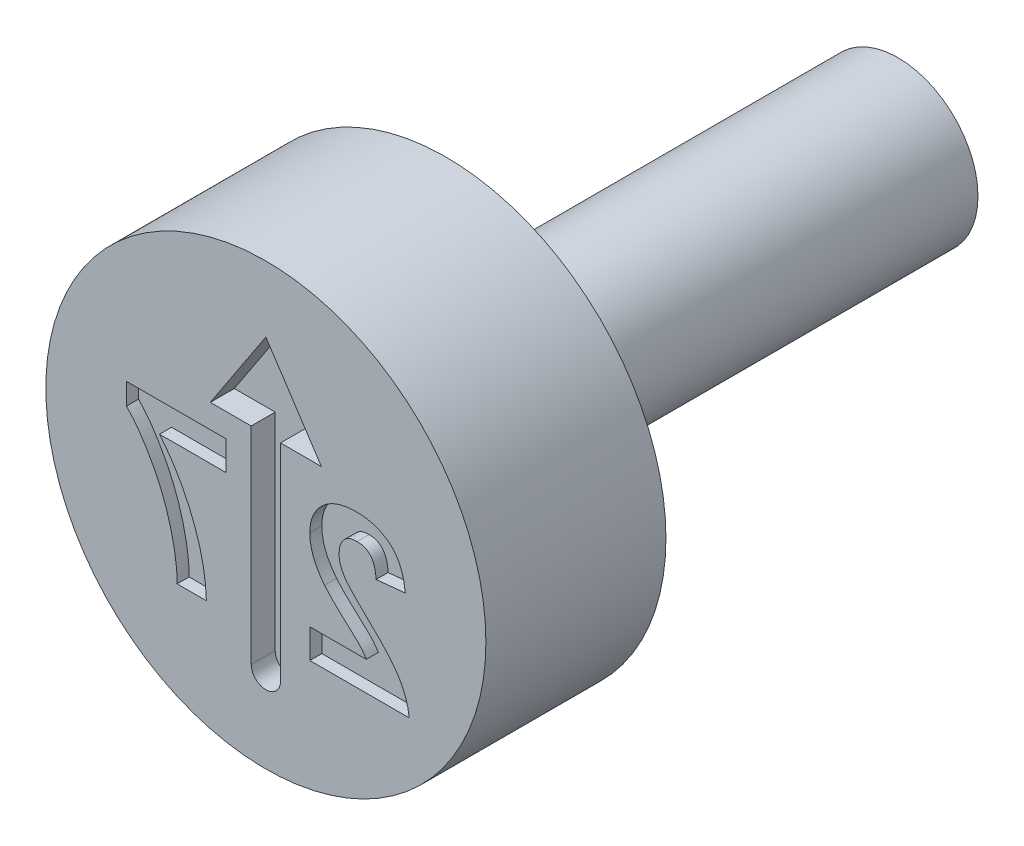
ISO-10303-21;
HEADER;
FILE_DESCRIPTION(('STEP AP214'),'2;1');
FILE_NAME('part.step','',(''),(''),'','','');
FILE_SCHEMA(('AUTOMOTIVE_DESIGN { 1 0 10303 214 1 1 1 1 }'));
ENDSEC;
DATA;
#1=APPLICATION_CONTEXT('core data for automotive mechanical design processes');
#2=APPLICATION_PROTOCOL_DEFINITION('international standard','automotive_design',2000,#1);
#3=PRODUCT_CONTEXT('',#1,'mechanical');
#4=PRODUCT('Part','Part','',(#3));
#5=PRODUCT_RELATED_PRODUCT_CATEGORY('part','',(#4));
#6=PRODUCT_DEFINITION_FORMATION('','',#4);
#7=PRODUCT_DEFINITION_CONTEXT('part definition',#1,'design');
#8=PRODUCT_DEFINITION('design','',#6,#7);
#9=PRODUCT_DEFINITION_SHAPE('','',#8);
#10=(LENGTH_UNIT() NAMED_UNIT(*) SI_UNIT(.MILLI.,.METRE.));
#11=(NAMED_UNIT(*) PLANE_ANGLE_UNIT() SI_UNIT($,.RADIAN.));
#12=(NAMED_UNIT(*) SI_UNIT($,.STERADIAN.) SOLID_ANGLE_UNIT());
#13=UNCERTAINTY_MEASURE_WITH_UNIT(LENGTH_MEASURE(1.E-05),#10,'distance_accuracy_value','');
#14=(GEOMETRIC_REPRESENTATION_CONTEXT(3) GLOBAL_UNCERTAINTY_ASSIGNED_CONTEXT((#13)) GLOBAL_UNIT_ASSIGNED_CONTEXT((#10,
#11,#12)) REPRESENTATION_CONTEXT('',''));
#15=CARTESIAN_POINT('',(0.,0.,0.));
#16=DIRECTION('',(0.,0.,1.));
#17=DIRECTION('',(1.,0.,0.));
#18=AXIS2_PLACEMENT_3D('',#15,#16,#17);
#19=CARTESIAN_POINT('',(0.,2.,-4.5));
#20=DIRECTION('',(0.,0.,1.));
#21=DIRECTION('',(1.,0.,0.));
#22=AXIS2_PLACEMENT_3D('',#19,#20,#21);
#23=PLANE('',#22);
#24=CARTESIAN_POINT('',(0.,0.,-4.5));
#25=DIRECTION('',(0.,0.,1.));
#26=DIRECTION('',(1.,0.,0.));
#27=AXIS2_PLACEMENT_3D('',#24,#25,#26);
#28=CIRCLE('',#27,5.5);
#29=CARTESIAN_POINT('',(5.5,0.,-4.5));
#30=VERTEX_POINT('',#29);
#31=EDGE_CURVE('E11',#30,#30,#28,.T.);
#32=ORIENTED_EDGE('',*,*,#31,.F.);
#33=EDGE_LOOP('',(#32));
#34=FACE_BOUND('',#33,.T.);
#35=CARTESIAN_POINT('',(0.,0.,-4.5));
#36=DIRECTION('',(0.,0.,1.));
#37=DIRECTION('',(1.,0.,0.));
#38=AXIS2_PLACEMENT_3D('',#35,#36,#37);
#39=CIRCLE('',#38,2.);
#40=CARTESIAN_POINT('',(2.,0.,-4.5));
#41=VERTEX_POINT('',#40);
#42=EDGE_CURVE('E462',#41,#41,#39,.T.);
#43=ORIENTED_EDGE('',*,*,#42,.T.);
#44=EDGE_LOOP('',(#43));
#45=FACE_BOUND('',#44,.T.);
#46=ADVANCED_FACE('F39',(#34,#45),#23,.F.);
#47=CARTESIAN_POINT('',(0.,0.,-0.403888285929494));
#48=DIRECTION('',(0.,0.,1.));
#49=DIRECTION('',(1.,0.,0.));
#50=AXIS2_PLACEMENT_3D('',#47,#48,#49);
#51=CYLINDRICAL_SURFACE('',#50,5.5);
#52=CARTESIAN_POINT('',(0.,0.,0.));
#53=DIRECTION('',(0.,0.,1.));
#54=DIRECTION('',(1.,0.,0.));
#55=AXIS2_PLACEMENT_3D('',#52,#53,#54);
#56=CIRCLE('',#55,5.5);
#57=CARTESIAN_POINT('',(5.5,0.,0.));
#58=VERTEX_POINT('',#57);
#59=EDGE_CURVE('E46',#58,#58,#56,.T.);
#60=ORIENTED_EDGE('',*,*,#59,.F.);
#61=EDGE_LOOP('',(#60));
#62=FACE_BOUND('',#61,.T.);
#63=ORIENTED_EDGE('',*,*,#31,.T.);
#64=EDGE_LOOP('',(#63));
#65=FACE_BOUND('',#64,.T.);
#66=ADVANCED_FACE('F484',(#62,#65),#51,.T.);
#67=CARTESIAN_POINT('',(0.,5.5,0.));
#68=DIRECTION('',(0.,0.,-1.));
#69=DIRECTION('',(-1.,0.,0.));
#70=AXIS2_PLACEMENT_3D('',#67,#68,#69);
#71=PLANE('',#70);
#72=DIRECTION('',(0.,1.,0.));
#73=VECTOR('',#72,1.);
#74=CARTESIAN_POINT('',(-1.00000682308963,0.420512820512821,0.));
#75=LINE('',#74,#73);
#76=CARTESIAN_POINT('',(-1.00000682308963,0.420512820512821,0.));
#77=VERTEX_POINT('',#76);
#78=CARTESIAN_POINT('',(-1.00000682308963,1.15128205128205,0.));
#79=VERTEX_POINT('',#78);
#80=EDGE_CURVE('E708',#77,#79,#75,.T.);
#81=ORIENTED_EDGE('',*,*,#80,.F.);
#82=DIRECTION('',(1.,0.,0.));
#83=VECTOR('',#82,1.);
#84=CARTESIAN_POINT('',(-2.6571782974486,0.420512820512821,0.));
#85=LINE('',#84,#83);
#86=CARTESIAN_POINT('',(-2.6571782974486,0.420512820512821,0.));
#87=VERTEX_POINT('',#86);
#88=EDGE_CURVE('E53',#87,#77,#85,.T.);
#89=ORIENTED_EDGE('',*,*,#88,.F.);
#90=CARTESIAN_POINT('',(-1.48718631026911,-2.6,0.));
#91=CARTESIAN_POINT('',(-1.48962983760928,-2.53526242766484,0.));
#92=CARTESIAN_POINT('',(-1.4945440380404,-2.40506809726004,0.));
#93=CARTESIAN_POINT('',(-1.5129302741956,-2.20965065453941,0.));
#94=CARTESIAN_POINT('',(-1.54180783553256,-2.01350556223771,0.));
#95=CARTESIAN_POINT('',(-1.57767570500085,-1.81617949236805,0.));
#96=CARTESIAN_POINT('',(-1.62503023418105,-1.61815282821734,0.));
#97=CARTESIAN_POINT('',(-1.67907626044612,-1.4186920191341,0.));
#98=CARTESIAN_POINT('',(-1.74454489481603,-1.21886238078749,0.));
#99=CARTESIAN_POINT('',(-1.81793347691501,-1.01904599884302,0.));
#100=CARTESIAN_POINT('',(-1.89895061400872,-0.821139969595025,0.));
#101=CARTESIAN_POINT('',(-1.98724789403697,-0.627598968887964,0.));
#102=CARTESIAN_POINT('',(-2.08259705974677,-0.439630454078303,0.));
#103=CARTESIAN_POINT('',(-2.1837581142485,-0.256573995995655,0.));
#104=CARTESIAN_POINT('',(-2.29190792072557,-0.0790184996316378,0.));
#105=CARTESIAN_POINT('',(-2.40712790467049,0.0928432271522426,0.));
#106=CARTESIAN_POINT('',(-2.52778369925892,0.260254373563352,0.));
#107=CARTESIAN_POINT('',(-2.6140540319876,0.367102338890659,0.));
#108=CARTESIAN_POINT('',(-2.6571782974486,0.420512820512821,0.));
#109=B_SPLINE_CURVE_WITH_KNOTS('',3,(#90,#91,#92,#93,#94,#95,#96,#97,#98,#99,#100,#101,#102,
#103,#104,#105,#106,#107,#108),.UNSPECIFIED.,.F.,.F.,(4,1,1,1,1,1,1,1,1,1,1,1,1,1,1,1,4),(0.,
0.0589531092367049,0.118561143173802,0.178522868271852,0.239353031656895,0.301026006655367,
0.363773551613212,0.427382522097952,0.492333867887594,0.557475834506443,0.621960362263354,
0.685889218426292,0.749254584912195,0.812267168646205,0.875035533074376,0.937533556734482,1.),.UNSPECIFIED.);
#110=CARTESIAN_POINT('',(-1.48718631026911,-2.6,0.));
#111=VERTEX_POINT('',#110);
#112=EDGE_CURVE('E238',#111,#87,#109,.T.);
#113=ORIENTED_EDGE('',*,*,#112,.F.);
#114=DIRECTION('',(1.,0.,0.));
#115=VECTOR('',#114,1.);
#116=CARTESIAN_POINT('',(-2.21795554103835,-2.6,0.));
#117=LINE('',#116,#115);
#118=CARTESIAN_POINT('',(-2.21795554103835,-2.6,0.));
#119=VERTEX_POINT('',#118);
#120=EDGE_CURVE('E241',#119,#111,#117,.T.);
#121=ORIENTED_EDGE('',*,*,#120,.F.);
#122=CARTESIAN_POINT('',(-3.48462220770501,0.615384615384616,0.));
#123=CARTESIAN_POINT('',(-3.45870298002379,0.589012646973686,0.));
#124=CARTESIAN_POINT('',(-3.40542049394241,0.534799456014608,0.));
#125=CARTESIAN_POINT('',(-3.32909854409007,0.446074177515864,0.));
#126=CARTESIAN_POINT('',(-3.25164578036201,0.349791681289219,0.));
#127=CARTESIAN_POINT('',(-3.1746818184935,0.244654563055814,0.));
#128=CARTESIAN_POINT('',(-3.09581427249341,0.132323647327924,0.));
#129=CARTESIAN_POINT('',(-3.01850909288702,0.0106456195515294,0.));
#130=CARTESIAN_POINT('',(-2.94010434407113,-0.118800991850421,0.));
#131=CARTESIAN_POINT('',(-2.83454676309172,-0.301903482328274,0.));
#132=CARTESIAN_POINT('',(-2.71116312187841,-0.541091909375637,0.));
#133=CARTESIAN_POINT('',(-2.58062975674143,-0.838415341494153,0.));
#134=CARTESIAN_POINT('',(-2.46942130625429,-1.14486984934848,0.));
#135=CARTESIAN_POINT('',(-2.39327064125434,-1.40599168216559,0.));
#136=CARTESIAN_POINT('',(-2.34181860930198,-1.6152804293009,0.));
#137=CARTESIAN_POINT('',(-2.30820234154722,-1.76831732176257,0.));
#138=CARTESIAN_POINT('',(-2.27990457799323,-1.91704755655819,0.));
#139=CARTESIAN_POINT('',(-2.2568843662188,-2.06173252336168,0.));
#140=CARTESIAN_POINT('',(-2.23970373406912,-2.20243822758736,0.));
#141=CARTESIAN_POINT('',(-2.22612810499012,-2.33867548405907,0.));
#142=CARTESIAN_POINT('',(-2.21943046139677,-2.47077650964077,0.));
#143=CARTESIAN_POINT('',(-2.21844215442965,-2.55736591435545,0.));
#144=CARTESIAN_POINT('',(-2.21795554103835,-2.6,0.));
#145=B_SPLINE_CURVE_WITH_KNOTS('',3,(#122,#123,#124,#125,#126,#127,#128,#129,#130,#131,#132,
#133,#134,#135,#136,#137,#138,#139,#140,#141,#142,#143,#144),.UNSPECIFIED.,.F.,.F.,(4,1,1,1,1,1,
1,1,1,1,1,1,1,1,1,1,1,1,1,1,4),(0.,0.0314272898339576,0.0646054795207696,0.0994393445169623,
0.136456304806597,0.175351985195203,0.216100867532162,0.258977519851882,0.304007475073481,
0.395756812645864,0.487615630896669,0.579873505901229,0.672707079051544,0.718694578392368,
0.76307923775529,0.80589344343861,0.847386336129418,0.88760014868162,0.926386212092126,
0.963754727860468,1.),.UNSPECIFIED.);
#146=CARTESIAN_POINT('',(-3.48462220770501,0.615384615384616,0.));
#147=VERTEX_POINT('',#146);
#148=EDGE_CURVE('E694',#147,#119,#145,.T.);
#149=ORIENTED_EDGE('',*,*,#148,.F.);
#150=DIRECTION('',(0.,-1.,0.));
#151=VECTOR('',#150,1.);
#152=CARTESIAN_POINT('',(-3.48462220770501,1.15128205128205,0.));
#153=LINE('',#152,#151);
#154=CARTESIAN_POINT('',(-3.48462220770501,1.15128205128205,0.));
#155=VERTEX_POINT('',#154);
#156=EDGE_CURVE('E699',#155,#147,#153,.T.);
#157=ORIENTED_EDGE('',*,*,#156,.F.);
#158=DIRECTION('',(-1.,0.,0.));
#159=VECTOR('',#158,1.);
#160=CARTESIAN_POINT('',(-1.00000682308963,1.15128205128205,0.));
#161=LINE('',#160,#159);
#162=EDGE_CURVE('E705',#79,#155,#161,.T.);
#163=ORIENTED_EDGE('',*,*,#162,.F.);
#164=EDGE_LOOP('',(#81,#89,#113,#121,#149,#157,#163));
#165=FACE_BOUND('',#164,.T.);
#166=DIRECTION('',(0.,-1.,0.));
#167=VECTOR('',#166,1.);
#168=CARTESIAN_POINT('',(1.0987624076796,-1.86923076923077,0.));
#169=LINE('',#168,#167);
#170=CARTESIAN_POINT('',(1.0987624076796,-1.86923076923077,0.));
#171=VERTEX_POINT('',#170);
#172=CARTESIAN_POINT('',(1.0987624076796,-2.6,0.));
#173=VERTEX_POINT('',#172);
#174=EDGE_CURVE('E310',#171,#173,#169,.T.);
#175=ORIENTED_EDGE('',*,*,#174,.F.);
#176=DIRECTION('',(-1.,0.,0.));
#177=VECTOR('',#176,1.);
#178=CARTESIAN_POINT('',(2.5108217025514,-1.86923076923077,0.));
#179=LINE('',#178,#177);
#180=CARTESIAN_POINT('',(2.5108217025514,-1.86923076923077,0.));
#181=VERTEX_POINT('',#180);
#182=EDGE_CURVE('E61',#181,#171,#179,.T.);
#183=ORIENTED_EDGE('',*,*,#182,.F.);
#184=CARTESIAN_POINT('',(1.46719189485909,-0.786778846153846,0.));
#185=CARTESIAN_POINT('',(1.47874994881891,-0.80133624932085,0.));
#186=CARTESIAN_POINT('',(1.50350462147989,-0.832514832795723,0.));
#187=CARTESIAN_POINT('',(1.545618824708,-0.880322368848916,0.));
#188=CARTESIAN_POINT('',(1.59442556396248,-0.932543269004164,0.));
#189=CARTESIAN_POINT('',(1.64923546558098,-0.990154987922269,0.));
#190=CARTESIAN_POINT('',(1.71185900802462,-1.05111733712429,0.));
#191=CARTESIAN_POINT('',(1.78004299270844,-1.11797971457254,0.));
#192=CARTESIAN_POINT('',(1.85678771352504,-1.18732188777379,0.));
#193=CARTESIAN_POINT('',(1.93627664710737,-1.26087360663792,0.));
#194=CARTESIAN_POINT('',(2.01611109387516,-1.33246046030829,0.));
#195=CARTESIAN_POINT('',(2.08949046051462,-1.40045210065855,0.));
#196=CARTESIAN_POINT('',(2.15614334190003,-1.4606100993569,0.));
#197=CARTESIAN_POINT('',(2.21296558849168,-1.51625545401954,0.));
#198=CARTESIAN_POINT('',(2.26329947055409,-1.56359040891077,0.));
#199=CARTESIAN_POINT('',(2.30533078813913,-1.60504224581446,0.));
#200=CARTESIAN_POINT('',(2.33984604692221,-1.63960744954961,0.));
#201=CARTESIAN_POINT('',(2.3874058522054,-1.69348583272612,0.));
#202=CARTESIAN_POINT('',(2.44792030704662,-1.76635636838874,0.));
#203=CARTESIAN_POINT('',(2.49049470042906,-1.83598622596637,0.));
#204=CARTESIAN_POINT('',(2.5108217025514,-1.86923076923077,0.));
#205=B_SPLINE_CURVE_WITH_KNOTS('',3,(#184,#185,#186,#187,#188,#189,#190,#191,#192,#193,#194,
#195,#196,#197,#198,#199,#200,#201,#202,#203,#204),.UNSPECIFIED.,.F.,.F.,(4,1,1,1,1,1,1,1,1,1,1,
1,1,1,1,1,1,1,4),(0.,0.0369753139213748,0.0791925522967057,0.126700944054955,0.17918407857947,
0.23736864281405,0.300558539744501,0.369153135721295,0.443112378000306,0.516018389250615,
0.582473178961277,0.642136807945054,0.694619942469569,0.740679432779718,0.779589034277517,
0.812073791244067,0.837814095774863,0.922564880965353,1.),.UNSPECIFIED.);
#206=CARTESIAN_POINT('',(1.46719189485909,-0.786778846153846,0.));
#207=VERTEX_POINT('',#206);
#208=EDGE_CURVE('E381',#207,#181,#205,.T.);
#209=ORIENTED_EDGE('',*,*,#208,.F.);
#210=CARTESIAN_POINT('',(1.0987624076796,0.166266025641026,0.));
#211=CARTESIAN_POINT('',(1.09969211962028,0.124844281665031,0.));
#212=CARTESIAN_POINT('',(1.10153652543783,0.0426698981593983,0.));
#213=CARTESIAN_POINT('',(1.11919534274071,-0.0788083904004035,0.));
#214=CARTESIAN_POINT('',(1.14617457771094,-0.19748540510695,0.));
#215=CARTESIAN_POINT('',(1.1860477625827,-0.313651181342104,0.));
#216=CARTESIAN_POINT('',(1.23659011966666,-0.43009226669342,0.));
#217=CARTESIAN_POINT('',(1.30174043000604,-0.54707002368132,0.));
#218=CARTESIAN_POINT('',(1.37738486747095,-0.668112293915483,0.));
#219=CARTESIAN_POINT('',(1.43661148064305,-0.746371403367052,0.));
#220=CARTESIAN_POINT('',(1.46719189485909,-0.786778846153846,0.));
#221=B_SPLINE_CURVE_WITH_KNOTS('',3,(#210,#211,#212,#213,#214,#215,#216,#217,#218,#219,#220),
.UNSPECIFIED.,.F.,.F.,(4,1,1,1,1,1,1,1,4),(0.,0.119176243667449,0.236427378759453,
0.352663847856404,0.469086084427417,0.589462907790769,0.717601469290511,0.854189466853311,1.),.UNSPECIFIED.);
#222=CARTESIAN_POINT('',(1.0987624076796,0.166266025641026,0.));
#223=VERTEX_POINT('',#222);
#224=EDGE_CURVE('E373',#223,#207,#221,.T.);
#225=ORIENTED_EDGE('',*,*,#224,.F.);
#226=CARTESIAN_POINT('',(2.2649483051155,1.2,0.));
#227=CARTESIAN_POINT('',(2.22076497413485,1.19915081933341,0.));
#228=CARTESIAN_POINT('',(2.13471238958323,1.19749693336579,0.));
#229=CARTESIAN_POINT('',(2.0090908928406,1.18383912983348,0.));
#230=CARTESIAN_POINT('',(1.89107852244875,1.16002477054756,0.));
#231=CARTESIAN_POINT('',(1.77964353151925,1.12847928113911,0.));
#232=CARTESIAN_POINT('',(1.67593029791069,1.08636374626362,0.));
#233=CARTESIAN_POINT('',(1.57907458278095,1.03544781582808,0.));
#234=CARTESIAN_POINT('',(1.49060072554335,0.973799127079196,0.));
#235=CARTESIAN_POINT('',(1.40918990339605,0.904779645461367,0.));
#236=CARTESIAN_POINT('',(1.33641514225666,0.828880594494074,0.));
#237=CARTESIAN_POINT('',(1.2726710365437,0.747921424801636,0.));
#238=CARTESIAN_POINT('',(1.21926643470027,0.661958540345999,0.));
#239=CARTESIAN_POINT('',(1.17445177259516,0.572039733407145,0.));
#240=CARTESIAN_POINT('',(1.1411771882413,0.476718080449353,0.));
#241=CARTESIAN_POINT('',(1.11693187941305,0.377311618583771,0.));
#242=CARTESIAN_POINT('',(1.10085626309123,0.273356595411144,0.));
#243=CARTESIAN_POINT('',(1.09946807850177,0.202357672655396,0.));
#244=CARTESIAN_POINT('',(1.0987624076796,0.166266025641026,0.));
#245=B_SPLINE_CURVE_WITH_KNOTS('',3,(#226,#227,#228,#229,#230,#231,#232,#233,#234,#235,#236,
#237,#238,#239,#240,#241,#242,#243,#244),.UNSPECIFIED.,.F.,.F.,(4,1,1,1,1,1,1,1,1,1,1,1,1,1,1,1,
4),(0.,0.0756723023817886,0.147381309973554,0.216084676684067,0.28169803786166,
0.345459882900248,0.407485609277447,0.46873129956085,0.529782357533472,0.590032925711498,
0.648548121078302,0.70595351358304,0.763101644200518,0.820289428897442,0.878479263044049,
0.938226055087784,1.),.UNSPECIFIED.);
#246=CARTESIAN_POINT('',(2.2649483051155,1.2,0.));
#247=VERTEX_POINT('',#246);
#248=EDGE_CURVE('E365',#247,#223,#245,.T.);
#249=ORIENTED_EDGE('',*,*,#248,.F.);
#250=CARTESIAN_POINT('',(3.48594189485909,0.0536057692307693,0.));
#251=CARTESIAN_POINT('',(3.48006662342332,0.102941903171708,0.));
#252=CARTESIAN_POINT('',(3.46867541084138,0.198596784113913,0.));
#253=CARTESIAN_POINT('',(3.44024844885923,0.335990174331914,0.));
#254=CARTESIAN_POINT('',(3.40424675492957,0.462741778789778,0.));
#255=CARTESIAN_POINT('',(3.35895400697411,0.578616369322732,0.));
#256=CARTESIAN_POINT('',(3.30624220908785,0.684350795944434,0.));
#257=CARTESIAN_POINT('',(3.2434226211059,0.778358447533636,0.));
#258=CARTESIAN_POINT('',(3.17269022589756,0.861680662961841,0.));
#259=CARTESIAN_POINT('',(3.09398389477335,0.934273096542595,0.));
#260=CARTESIAN_POINT('',(3.00780398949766,0.996366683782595,0.));
#261=CARTESIAN_POINT('',(2.91737364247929,1.05179473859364,0.));
#262=CARTESIAN_POINT('',(2.82092559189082,1.09726336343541,0.));
#263=CARTESIAN_POINT('',(2.71952173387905,1.13473634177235,0.));
#264=CARTESIAN_POINT('',(2.6132078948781,1.16468444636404,0.));
#265=CARTESIAN_POINT('',(2.50149235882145,1.18448572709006,0.));
#266=CARTESIAN_POINT('',(2.38506459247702,1.19841402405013,0.));
#267=CARTESIAN_POINT('',(2.30559051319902,1.19946337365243,0.));
#268=CARTESIAN_POINT('',(2.2649483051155,1.2,0.));
#269=B_SPLINE_CURVE_WITH_KNOTS('',3,(#250,#251,#252,#253,#254,#255,#256,#257,#258,#259,#260,
#261,#262,#263,#264,#265,#266,#267,#268),.UNSPECIFIED.,.F.,.F.,(4,1,1,1,1,1,1,1,1,1,1,1,1,1,1,1,
4),(0.,0.0794357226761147,0.154013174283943,0.224141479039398,0.289934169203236,
0.352732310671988,0.412725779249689,0.470302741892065,0.527168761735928,0.583502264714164,
0.639948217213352,0.696584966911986,0.753726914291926,0.812707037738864,0.872963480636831,
0.935034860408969,1.),.UNSPECIFIED.);
#270=CARTESIAN_POINT('',(3.48594189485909,0.0536057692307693,0.));
#271=VERTEX_POINT('',#270);
#272=EDGE_CURVE('E360',#271,#247,#269,.T.);
#273=ORIENTED_EDGE('',*,*,#272,.F.);
#274=DIRECTION('',(0.995240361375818,0.0974506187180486,0.));
#275=VECTOR('',#274,1.);
#276=CARTESIAN_POINT('',(2.75517266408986,-0.0179487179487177,0.));
#277=LINE('',#276,#275);
#278=CARTESIAN_POINT('',(2.75517266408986,-0.0179487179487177,0.));
#279=VERTEX_POINT('',#278);
#280=EDGE_CURVE('E354',#279,#271,#277,.T.);
#281=ORIENTED_EDGE('',*,*,#280,.F.);
#282=CARTESIAN_POINT('',(2.28017266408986,0.566666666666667,0.));
#283=CARTESIAN_POINT('',(2.31331716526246,0.565165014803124,0.));
#284=CARTESIAN_POINT('',(2.37734518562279,0.562264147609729,0.));
#285=CARTESIAN_POINT('',(2.46834289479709,0.536922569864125,0.));
#286=CARTESIAN_POINT('',(2.54794909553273,0.493053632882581,0.));
#287=CARTESIAN_POINT('',(2.6046807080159,0.443060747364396,0.));
#288=CARTESIAN_POINT('',(2.64300560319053,0.394446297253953,0.));
#289=CARTESIAN_POINT('',(2.66911884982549,0.35208200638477,0.));
#290=CARTESIAN_POINT('',(2.69162642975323,0.303943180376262,0.));
#291=CARTESIAN_POINT('',(2.71157002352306,0.250571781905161,0.));
#292=CARTESIAN_POINT('',(2.72732320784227,0.19135638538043,0.));
#293=CARTESIAN_POINT('',(2.74000984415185,0.126747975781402,0.));
#294=CARTESIAN_POINT('',(2.75023343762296,0.0563988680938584,0.));
#295=CARTESIAN_POINT('',(2.75348472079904,0.00745900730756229,0.));
#296=CARTESIAN_POINT('',(2.75517266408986,-0.0179487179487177,0.));
#297=B_SPLINE_CURVE_WITH_KNOTS('',3,(#282,#283,#284,#285,#286,#287,#288,#289,#290,#291,#292,
#293,#294,#295,#296),.UNSPECIFIED.,.F.,.F.,(4,1,1,1,1,1,1,1,1,1,1,1,4),(0.,0.116899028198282,
0.225823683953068,0.330086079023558,0.435451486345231,0.490306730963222,0.548244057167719,
0.610766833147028,0.677675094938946,0.749188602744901,0.826858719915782,0.910111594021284,1.),.UNSPECIFIED.);
#298=CARTESIAN_POINT('',(2.28017266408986,0.566666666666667,0.));
#299=VERTEX_POINT('',#298);
#300=EDGE_CURVE('E346',#299,#279,#297,.T.);
#301=ORIENTED_EDGE('',*,*,#300,.F.);
#302=CARTESIAN_POINT('',(1.82953163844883,0.0680689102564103,0.));
#303=CARTESIAN_POINT('',(1.83090027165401,0.105982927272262,0.));
#304=CARTESIAN_POINT('',(1.8334896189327,0.177713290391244,0.));
#305=CARTESIAN_POINT('',(1.85520174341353,0.278938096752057,0.));
#306=CARTESIAN_POINT('',(1.89370467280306,0.365955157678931,0.));
#307=CARTESIAN_POINT('',(1.94671612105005,0.439031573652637,0.));
#308=CARTESIAN_POINT('',(2.01374920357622,0.496286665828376,0.));
#309=CARTESIAN_POINT('',(2.09211282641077,0.538592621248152,0.));
#310=CARTESIAN_POINT('',(2.18295410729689,0.561982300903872,0.));
#311=CARTESIAN_POINT('',(2.2468027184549,0.5650587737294,0.));
#312=CARTESIAN_POINT('',(2.28017266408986,0.566666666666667,0.));
#313=B_SPLINE_CURVE_WITH_KNOTS('',3,(#302,#303,#304,#305,#306,#307,#308,#309,#310,#311,#312),
.UNSPECIFIED.,.F.,.F.,(4,1,1,1,1,1,1,1,4),(0.,0.149140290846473,0.282161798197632,
0.404655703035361,0.521109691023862,0.634416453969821,0.748796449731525,0.868710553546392,1.),.UNSPECIFIED.);
#314=CARTESIAN_POINT('',(1.82953163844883,0.0680689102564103,0.));
#315=VERTEX_POINT('',#314);
#316=EDGE_CURVE('E338',#315,#299,#313,.T.);
#317=ORIENTED_EDGE('',*,*,#316,.F.);
#318=CARTESIAN_POINT('',(1.97416304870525,-0.371153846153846,0.));
#319=CARTESIAN_POINT('',(1.952161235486,-0.334606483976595,0.));
#320=CARTESIAN_POINT('',(1.90972228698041,-0.264110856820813,0.));
#321=CARTESIAN_POINT('',(1.86318445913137,-0.153255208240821,0.));
#322=CARTESIAN_POINT('',(1.83525072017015,-0.042422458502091,0.));
#323=CARTESIAN_POINT('',(1.8314174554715,0.0316353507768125,0.));
#324=CARTESIAN_POINT('',(1.82953163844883,0.0680689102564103,0.));
#325=B_SPLINE_CURVE_WITH_KNOTS('',3,(#318,#319,#320,#321,#322,#323,#324),.UNSPECIFIED.,.F.,.F.,
(4,1,1,1,4),(0.,0.272795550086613,0.526191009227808,0.766904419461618,1.),.UNSPECIFIED.);
#326=CARTESIAN_POINT('',(1.97416304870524,-0.371153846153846,0.));
#327=VERTEX_POINT('',#326);
#328=EDGE_CURVE('E330',#327,#315,#325,.T.);
#329=ORIENTED_EDGE('',*,*,#328,.F.);
#330=CARTESIAN_POINT('',(2.55573356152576,-0.984695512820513,0.));
#331=CARTESIAN_POINT('',(2.5181628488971,-0.948429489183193,0.));
#332=CARTESIAN_POINT('',(2.44663927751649,-0.879389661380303,0.));
#333=CARTESIAN_POINT('',(2.34478957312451,-0.780527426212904,0.));
#334=CARTESIAN_POINT('',(2.25525318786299,-0.68964493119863,0.));
#335=CARTESIAN_POINT('',(2.17615804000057,-0.609097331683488,0.));
#336=CARTESIAN_POINT('',(2.10933133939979,-0.536833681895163,0.));
#337=CARTESIAN_POINT('',(2.05389404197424,-0.473988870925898,0.));
#338=CARTESIAN_POINT('',(2.00914404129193,-0.420306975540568,0.));
#339=CARTESIAN_POINT('',(1.98490740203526,-0.386251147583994,0.));
#340=CARTESIAN_POINT('',(1.97416304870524,-0.371153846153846,0.));
#341=B_SPLINE_CURVE_WITH_KNOTS('',3,(#330,#331,#332,#333,#334,#335,#336,#337,#338,#339,#340),
.UNSPECIFIED.,.F.,.F.,(4,1,1,1,1,1,1,1,4),(0.,0.18509006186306,0.352356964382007,
0.503079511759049,0.637279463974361,0.752473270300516,0.851885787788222,0.934339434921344,1.),.UNSPECIFIED.);
#342=CARTESIAN_POINT('',(2.55573356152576,-0.984695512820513,0.));
#343=VERTEX_POINT('',#342);
#344=EDGE_CURVE('E322',#343,#327,#341,.T.);
#345=ORIENTED_EDGE('',*,*,#344,.F.);
#346=CARTESIAN_POINT('',(3.58337779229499,-2.6,0.));
#347=CARTESIAN_POINT('',(3.57496546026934,-2.53754516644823,0.));
#348=CARTESIAN_POINT('',(3.55814551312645,-2.41267051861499,0.));
#349=CARTESIAN_POINT('',(3.50614424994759,-2.23026008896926,0.));
#350=CARTESIAN_POINT('',(3.43674037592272,-2.05225867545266,0.));
#351=CARTESIAN_POINT('',(3.36141565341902,-1.90740873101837,0.));
#352=CARTESIAN_POINT('',(3.28649687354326,-1.79080951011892,0.));
#353=CARTESIAN_POINT('',(3.21852306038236,-1.69526720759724,0.));
#354=CARTESIAN_POINT('',(3.1374327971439,-1.59361429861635,0.));
#355=CARTESIAN_POINT('',(3.04440279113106,-1.48503016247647,0.));
#356=CARTESIAN_POINT('',(2.93994716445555,-1.36917536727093,0.));
#357=CARTESIAN_POINT('',(2.8232866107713,-1.2464806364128,0.));
#358=CARTESIAN_POINT('',(2.69386464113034,-1.11753334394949,0.));
#359=CARTESIAN_POINT('',(2.60281398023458,-1.02997178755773,0.));
#360=CARTESIAN_POINT('',(2.55573356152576,-0.984695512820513,0.));
#361=B_SPLINE_CURVE_WITH_KNOTS('',3,(#346,#347,#348,#349,#350,#351,#352,#353,#354,#355,#356,
#357,#358,#359,#360),.UNSPECIFIED.,.F.,.F.,(4,1,1,1,1,1,1,1,1,1,1,1,4),(0.,0.0963574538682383,
0.192660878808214,0.289454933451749,0.388479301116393,0.441921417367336,0.501521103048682,
0.567882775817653,0.640891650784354,0.72037065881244,0.806636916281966,0.900015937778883,1.),.UNSPECIFIED.);
#362=CARTESIAN_POINT('',(3.58337779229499,-2.6,0.));
#363=VERTEX_POINT('',#362);
#364=EDGE_CURVE('E317',#363,#343,#361,.T.);
#365=ORIENTED_EDGE('',*,*,#364,.F.);
#366=DIRECTION('',(1.,0.,0.));
#367=VECTOR('',#366,1.);
#368=CARTESIAN_POINT('',(1.0987624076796,-2.6,0.));
#369=LINE('',#368,#367);
#370=EDGE_CURVE('E314',#173,#363,#369,.T.);
#371=ORIENTED_EDGE('',*,*,#370,.F.);
#372=EDGE_LOOP('',(#175,#183,#209,#225,#249,#273,#281,#301,#317,#329,#345,#365,#371));
#373=FACE_BOUND('',#372,.T.);
#374=DIRECTION('',(0.,1.,0.));
#375=VECTOR('',#374,1.);
#376=CARTESIAN_POINT('',(0.366422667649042,1.74359356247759,0.));
#377=LINE('',#376,#375);
#378=CARTESIAN_POINT('',(0.366422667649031,-3.4168913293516,0.));
#379=VERTEX_POINT('',#378);
#380=CARTESIAN_POINT('',(0.366422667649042,1.74359356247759,0.));
#381=VERTEX_POINT('',#380);
#382=EDGE_CURVE('E443',#379,#381,#377,.T.);
#383=ORIENTED_EDGE('',*,*,#382,.F.);
#384=CARTESIAN_POINT('',(3.14387868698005E-13,-3.4168913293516,0.));
#385=DIRECTION('',(0.,0.,1.));
#386=DIRECTION('',(1.,0.,0.));
#387=AXIS2_PLACEMENT_3D('',#384,#385,#386);
#388=CIRCLE('',#387,0.366422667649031);
#389=CARTESIAN_POINT('',(-0.366422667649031,-3.4168913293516,0.));
#390=VERTEX_POINT('',#389);
#391=EDGE_CURVE('E395',#390,#379,#388,.T.);
#392=ORIENTED_EDGE('',*,*,#391,.F.);
#393=DIRECTION('',(0.,-1.,0.));
#394=VECTOR('',#393,1.);
#395=CARTESIAN_POINT('',(-0.366422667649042,1.74359356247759,0.));
#396=LINE('',#395,#394);
#397=CARTESIAN_POINT('',(-0.366422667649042,1.74359356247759,0.));
#398=VERTEX_POINT('',#397);
#399=EDGE_CURVE('E423',#398,#390,#396,.T.);
#400=ORIENTED_EDGE('',*,*,#399,.F.);
#401=DIRECTION('',(1.,0.,0.));
#402=VECTOR('',#401,1.);
#403=CARTESIAN_POINT('',(-1.38878912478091,1.74359356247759,0.));
#404=LINE('',#403,#402);
#405=CARTESIAN_POINT('',(-1.38878912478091,1.74359356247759,0.));
#406=VERTEX_POINT('',#405);
#407=EDGE_CURVE('E455',#406,#398,#404,.T.);
#408=ORIENTED_EDGE('',*,*,#407,.F.);
#409=DIRECTION('',(-0.550159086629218,-0.835059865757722,0.));
#410=VECTOR('',#409,1.);
#411=CARTESIAN_POINT('',(0.,3.85156939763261,0.));
#412=LINE('',#411,#410);
#413=CARTESIAN_POINT('',(0.,3.85156939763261,0.));
#414=VERTEX_POINT('',#413);
#415=EDGE_CURVE('E452',#414,#406,#412,.T.);
#416=ORIENTED_EDGE('',*,*,#415,.F.);
#417=DIRECTION('',(-0.550159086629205,0.835059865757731,0.));
#418=VECTOR('',#417,1.);
#419=CARTESIAN_POINT('',(0.,3.85156939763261,0.));
#420=LINE('',#419,#418);
#421=CARTESIAN_POINT('',(1.38878912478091,1.74359356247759,0.));
#422=VERTEX_POINT('',#421);
#423=EDGE_CURVE('E449',#422,#414,#420,.T.);
#424=ORIENTED_EDGE('',*,*,#423,.F.);
#425=DIRECTION('',(1.,0.,0.));
#426=VECTOR('',#425,1.);
#427=CARTESIAN_POINT('',(1.38878912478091,1.74359356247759,0.));
#428=LINE('',#427,#426);
#429=EDGE_CURVE('E446',#381,#422,#428,.T.);
#430=ORIENTED_EDGE('',*,*,#429,.F.);
#431=EDGE_LOOP('',(#383,#392,#400,#408,#416,#424,#430));
#432=FACE_BOUND('',#431,.T.);
#433=ORIENTED_EDGE('',*,*,#59,.T.);
#434=EDGE_LOOP('',(#433));
#435=FACE_BOUND('',#434,.T.);
#436=ADVANCED_FACE('F482',(#165,#373,#432,#435),#71,.F.);
#437=CARTESIAN_POINT('',(0.,0.,-15.8));
#438=DIRECTION('',(0.,0.,1.));
#439=DIRECTION('',(1.,0.,0.));
#440=AXIS2_PLACEMENT_3D('',#437,#438,#439);
#441=PLANE('',#440);
#442=CARTESIAN_POINT('',(0.,0.,-15.8));
#443=DIRECTION('',(0.,0.,1.));
#444=DIRECTION('',(1.,0.,0.));
#445=AXIS2_PLACEMENT_3D('',#442,#443,#444);
#446=CIRCLE('',#445,2.);
#447=CARTESIAN_POINT('',(2.,0.,-15.8));
#448=VERTEX_POINT('',#447);
#449=EDGE_CURVE('E477',#448,#448,#446,.T.);
#450=ORIENTED_EDGE('',*,*,#449,.F.);
#451=EDGE_LOOP('',(#450));
#452=FACE_BOUND('',#451,.T.);
#453=ADVANCED_FACE('F497',(#452),#441,.F.);
#454=CARTESIAN_POINT('',(0.,0.,-0.403888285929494));
#455=DIRECTION('',(0.,0.,1.));
#456=DIRECTION('',(1.,0.,0.));
#457=AXIS2_PLACEMENT_3D('',#454,#455,#456);
#458=CYLINDRICAL_SURFACE('',#457,2.);
#459=ORIENTED_EDGE('',*,*,#42,.F.);
#460=EDGE_LOOP('',(#459));
#461=FACE_BOUND('',#460,.T.);
#462=ORIENTED_EDGE('',*,*,#449,.T.);
#463=EDGE_LOOP('',(#462));
#464=FACE_BOUND('',#463,.T.);
#465=ADVANCED_FACE('F493',(#461,#464),#458,.T.);
#466=CARTESIAN_POINT('',(3.14387868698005E-13,-3.4168913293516,-0.6));
#467=DIRECTION('',(0.,0.,1.));
#468=DIRECTION('',(1.,0.,0.));
#469=AXIS2_PLACEMENT_3D('',#466,#467,#468);
#470=CYLINDRICAL_SURFACE('',#469,0.366422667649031);
#471=ORIENTED_EDGE('',*,*,#391,.T.);
#472=DIRECTION('',(0.,0.,1.));
#473=VECTOR('',#472,1.);
#474=CARTESIAN_POINT('',(0.366422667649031,-3.4168913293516,-0.6));
#475=LINE('',#474,#473);
#476=CARTESIAN_POINT('',(0.366422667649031,-3.4168913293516,-0.6));
#477=VERTEX_POINT('',#476);
#478=EDGE_CURVE('E441',#477,#379,#475,.T.);
#479=ORIENTED_EDGE('',*,*,#478,.F.);
#480=CARTESIAN_POINT('',(3.14387868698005E-13,-3.4168913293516,-0.6));
#481=DIRECTION('',(0.,0.,1.));
#482=DIRECTION('',(1.,0.,0.));
#483=AXIS2_PLACEMENT_3D('',#480,#481,#482);
#484=CIRCLE('',#483,0.366422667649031);
#485=CARTESIAN_POINT('',(-0.366422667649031,-3.4168913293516,-0.6));
#486=VERTEX_POINT('',#485);
#487=EDGE_CURVE('E419',#486,#477,#484,.T.);
#488=ORIENTED_EDGE('',*,*,#487,.F.);
#489=DIRECTION('',(0.,0.,1.));
#490=VECTOR('',#489,1.);
#491=CARTESIAN_POINT('',(-0.366422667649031,-3.4168913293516,-0.6));
#492=LINE('',#491,#490);
#493=EDGE_CURVE('E460',#486,#390,#492,.T.);
#494=ORIENTED_EDGE('',*,*,#493,.T.);
#495=EDGE_LOOP('',(#471,#479,#488,#494));
#496=FACE_BOUND('',#495,.T.);
#497=ADVANCED_FACE('F496',(#496),#470,.F.);
#498=CARTESIAN_POINT('',(-0.366422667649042,1.74359356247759,-0.6));
#499=DIRECTION('',(-1.,0.,0.));
#500=DIRECTION('',(0.,-1.,0.));
#501=AXIS2_PLACEMENT_3D('',#498,#499,#500);
#502=PLANE('',#501);
#503=ORIENTED_EDGE('',*,*,#399,.T.);
#504=ORIENTED_EDGE('',*,*,#493,.F.);
#505=DIRECTION('',(0.,-1.,0.));
#506=VECTOR('',#505,1.);
#507=CARTESIAN_POINT('',(-0.366422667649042,1.74359356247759,-0.6));
#508=LINE('',#507,#506);
#509=CARTESIAN_POINT('',(-0.366422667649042,1.74359356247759,-0.6));
#510=VERTEX_POINT('',#509);
#511=EDGE_CURVE('E438',#510,#486,#508,.T.);
#512=ORIENTED_EDGE('',*,*,#511,.F.);
#513=DIRECTION('',(0.,0.,1.));
#514=VECTOR('',#513,1.);
#515=CARTESIAN_POINT('',(-0.366422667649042,1.74359356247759,-0.6));
#516=LINE('',#515,#514);
#517=EDGE_CURVE('E463',#510,#398,#516,.T.);
#518=ORIENTED_EDGE('',*,*,#517,.T.);
#519=EDGE_LOOP('',(#503,#504,#512,#518));
#520=FACE_BOUND('',#519,.T.);
#521=ADVANCED_FACE('F511',(#520),#502,.F.);
#522=CARTESIAN_POINT('',(-1.38878912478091,1.74359356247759,-0.6));
#523=DIRECTION('',(0.,-1.,0.));
#524=DIRECTION('',(0.,0.,-1.));
#525=AXIS2_PLACEMENT_3D('',#522,#523,#524);
#526=PLANE('',#525);
#527=ORIENTED_EDGE('',*,*,#407,.T.);
#528=ORIENTED_EDGE('',*,*,#517,.F.);
#529=DIRECTION('',(1.,0.,0.));
#530=VECTOR('',#529,1.);
#531=CARTESIAN_POINT('',(-1.38878912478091,1.74359356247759,-0.6));
#532=LINE('',#531,#530);
#533=CARTESIAN_POINT('',(-1.38878912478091,1.74359356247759,-0.6));
#534=VERTEX_POINT('',#533);
#535=EDGE_CURVE('E435',#534,#510,#532,.T.);
#536=ORIENTED_EDGE('',*,*,#535,.F.);
#537=DIRECTION('',(0.,0.,1.));
#538=VECTOR('',#537,1.);
#539=CARTESIAN_POINT('',(-1.38878912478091,1.74359356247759,-0.6));
#540=LINE('',#539,#538);
#541=EDGE_CURVE('E465',#534,#406,#540,.T.);
#542=ORIENTED_EDGE('',*,*,#541,.T.);
#543=EDGE_LOOP('',(#527,#528,#536,#542));
#544=FACE_BOUND('',#543,.T.);
#545=ADVANCED_FACE('F529',(#544),#526,.F.);
#546=CARTESIAN_POINT('',(0.,3.85156939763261,-0.6));
#547=DIRECTION('',(-0.835059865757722,0.550159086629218,0.));
#548=DIRECTION('',(-0.550159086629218,-0.835059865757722,0.));
#549=AXIS2_PLACEMENT_3D('',#546,#547,#548);
#550=PLANE('',#549);
#551=ORIENTED_EDGE('',*,*,#415,.T.);
#552=ORIENTED_EDGE('',*,*,#541,.F.);
#553=DIRECTION('',(-0.550159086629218,-0.835059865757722,0.));
#554=VECTOR('',#553,1.);
#555=CARTESIAN_POINT('',(0.,3.85156939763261,-0.6));
#556=LINE('',#555,#554);
#557=CARTESIAN_POINT('',(0.,3.85156939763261,-0.6));
#558=VERTEX_POINT('',#557);
#559=EDGE_CURVE('E432',#558,#534,#556,.T.);
#560=ORIENTED_EDGE('',*,*,#559,.F.);
#561=DIRECTION('',(0.,0.,1.));
#562=VECTOR('',#561,1.);
#563=CARTESIAN_POINT('',(0.,3.85156939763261,-0.6));
#564=LINE('',#563,#562);
#565=EDGE_CURVE('E467',#558,#414,#564,.T.);
#566=ORIENTED_EDGE('',*,*,#565,.T.);
#567=EDGE_LOOP('',(#551,#552,#560,#566));
#568=FACE_BOUND('',#567,.T.);
#569=ADVANCED_FACE('F525',(#568),#550,.F.);
#570=CARTESIAN_POINT('',(0.,3.85156939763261,-0.6));
#571=DIRECTION('',(0.835059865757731,0.550159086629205,0.));
#572=DIRECTION('',(-0.550159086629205,0.835059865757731,0.));
#573=AXIS2_PLACEMENT_3D('',#570,#571,#572);
#574=PLANE('',#573);
#575=ORIENTED_EDGE('',*,*,#423,.T.);
#576=ORIENTED_EDGE('',*,*,#565,.F.);
#577=DIRECTION('',(-0.550159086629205,0.835059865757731,0.));
#578=VECTOR('',#577,1.);
#579=CARTESIAN_POINT('',(0.,3.85156939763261,-0.6));
#580=LINE('',#579,#578);
#581=CARTESIAN_POINT('',(1.38878912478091,1.74359356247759,-0.6));
#582=VERTEX_POINT('',#581);
#583=EDGE_CURVE('E429',#582,#558,#580,.T.);
#584=ORIENTED_EDGE('',*,*,#583,.F.);
#585=DIRECTION('',(0.,0.,1.));
#586=VECTOR('',#585,1.);
#587=CARTESIAN_POINT('',(1.38878912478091,1.74359356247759,-0.6));
#588=LINE('',#587,#586);
#589=EDGE_CURVE('E469',#582,#422,#588,.T.);
#590=ORIENTED_EDGE('',*,*,#589,.T.);
#591=EDGE_LOOP('',(#575,#576,#584,#590));
#592=FACE_BOUND('',#591,.T.);
#593=ADVANCED_FACE('F521',(#592),#574,.F.);
#594=CARTESIAN_POINT('',(1.38878912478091,1.74359356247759,-0.6));
#595=DIRECTION('',(0.,-1.,0.));
#596=DIRECTION('',(0.,0.,-1.));
#597=AXIS2_PLACEMENT_3D('',#594,#595,#596);
#598=PLANE('',#597);
#599=ORIENTED_EDGE('',*,*,#429,.T.);
#600=ORIENTED_EDGE('',*,*,#589,.F.);
#601=DIRECTION('',(1.,0.,0.));
#602=VECTOR('',#601,1.);
#603=CARTESIAN_POINT('',(1.38878912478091,1.74359356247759,-0.6));
#604=LINE('',#603,#602);
#605=CARTESIAN_POINT('',(0.366422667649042,1.74359356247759,-0.6));
#606=VERTEX_POINT('',#605);
#607=EDGE_CURVE('E426',#606,#582,#604,.T.);
#608=ORIENTED_EDGE('',*,*,#607,.F.);
#609=DIRECTION('',(0.,0.,1.));
#610=VECTOR('',#609,1.);
#611=CARTESIAN_POINT('',(0.366422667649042,1.74359356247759,-0.6));
#612=LINE('',#611,#610);
#613=EDGE_CURVE('E471',#606,#381,#612,.T.);
#614=ORIENTED_EDGE('',*,*,#613,.T.);
#615=EDGE_LOOP('',(#599,#600,#608,#614));
#616=FACE_BOUND('',#615,.T.);
#617=ADVANCED_FACE('F517',(#616),#598,.F.);
#618=CARTESIAN_POINT('',(0.366422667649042,1.74359356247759,-0.6));
#619=DIRECTION('',(1.,0.,0.));
#620=DIRECTION('',(0.,1.,0.));
#621=AXIS2_PLACEMENT_3D('',#618,#619,#620);
#622=PLANE('',#621);
#623=ORIENTED_EDGE('',*,*,#382,.T.);
#624=ORIENTED_EDGE('',*,*,#613,.F.);
#625=DIRECTION('',(0.,1.,0.));
#626=VECTOR('',#625,1.);
#627=CARTESIAN_POINT('',(0.366422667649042,1.74359356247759,-0.6));
#628=LINE('',#627,#626);
#629=EDGE_CURVE('E422',#477,#606,#628,.T.);
#630=ORIENTED_EDGE('',*,*,#629,.F.);
#631=ORIENTED_EDGE('',*,*,#478,.T.);
#632=EDGE_LOOP('',(#623,#624,#630,#631));
#633=FACE_BOUND('',#632,.T.);
#634=ADVANCED_FACE('F513',(#633),#622,.F.);
#635=CARTESIAN_POINT('',(3.14387868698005E-13,-3.4168913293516,-0.6));
#636=DIRECTION('',(0.,0.,1.));
#637=DIRECTION('',(1.,0.,0.));
#638=AXIS2_PLACEMENT_3D('',#635,#636,#637);
#639=PLANE('',#638);
#640=ORIENTED_EDGE('',*,*,#487,.T.);
#641=ORIENTED_EDGE('',*,*,#629,.T.);
#642=ORIENTED_EDGE('',*,*,#607,.T.);
#643=ORIENTED_EDGE('',*,*,#583,.T.);
#644=ORIENTED_EDGE('',*,*,#559,.T.);
#645=ORIENTED_EDGE('',*,*,#535,.T.);
#646=ORIENTED_EDGE('',*,*,#511,.T.);
#647=EDGE_LOOP('',(#640,#641,#642,#643,#644,#645,#646));
#648=FACE_BOUND('',#647,.T.);
#649=ADVANCED_FACE('F516',(#648),#639,.T.);
#650=CARTESIAN_POINT('',(2.5108217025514,-1.86923076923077,-0.3));
#651=DIRECTION('',(0.,1.,0.));
#652=DIRECTION('',(0.,0.,1.));
#653=AXIS2_PLACEMENT_3D('',#650,#651,#652);
#654=PLANE('',#653);
#655=ORIENTED_EDGE('',*,*,#182,.T.);
#656=DIRECTION('',(0.,0.,1.));
#657=VECTOR('',#656,1.);
#658=CARTESIAN_POINT('',(1.0987624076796,-1.86923076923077,-0.3));
#659=LINE('',#658,#657);
#660=CARTESIAN_POINT('',(1.0987624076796,-1.86923076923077,-0.3));
#661=VERTEX_POINT('',#660);
#662=EDGE_CURVE('E300',#661,#171,#659,.T.);
#663=ORIENTED_EDGE('',*,*,#662,.F.);
#664=DIRECTION('',(-1.,0.,0.));
#665=VECTOR('',#664,1.);
#666=CARTESIAN_POINT('',(2.5108217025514,-1.86923076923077,-0.3));
#667=LINE('',#666,#665);
#668=CARTESIAN_POINT('',(2.5108217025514,-1.86923076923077,-0.3));
#669=VERTEX_POINT('',#668);
#670=EDGE_CURVE('E389',#669,#661,#667,.T.);
#671=ORIENTED_EDGE('',*,*,#670,.F.);
#672=DIRECTION('',(0.,0.,1.));
#673=VECTOR('',#672,1.);
#674=CARTESIAN_POINT('',(2.5108217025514,-1.86923076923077,-0.3));
#675=LINE('',#674,#673);
#676=EDGE_CURVE('E390',#669,#181,#675,.T.);
#677=ORIENTED_EDGE('',*,*,#676,.T.);
#678=EDGE_LOOP('',(#655,#663,#671,#677));
#679=FACE_BOUND('',#678,.T.);
#680=ADVANCED_FACE('F290',(#679),#654,.F.);
#681=CARTESIAN_POINT('',(1.46719189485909,-0.786778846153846,-0.3));
#682=CARTESIAN_POINT('',(1.47874994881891,-0.80133624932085,-0.3));
#683=CARTESIAN_POINT('',(1.50350462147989,-0.832514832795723,-0.3));
#684=CARTESIAN_POINT('',(1.545618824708,-0.880322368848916,-0.3));
#685=CARTESIAN_POINT('',(1.59442556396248,-0.932543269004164,-0.3));
#686=CARTESIAN_POINT('',(1.64923546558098,-0.990154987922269,-0.3));
#687=CARTESIAN_POINT('',(1.71185900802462,-1.05111733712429,-0.3));
#688=CARTESIAN_POINT('',(1.78004299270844,-1.11797971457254,-0.3));
#689=CARTESIAN_POINT('',(1.85678771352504,-1.18732188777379,-0.3));
#690=CARTESIAN_POINT('',(1.93627664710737,-1.26087360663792,-0.3));
#691=CARTESIAN_POINT('',(2.01611109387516,-1.33246046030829,-0.3));
#692=CARTESIAN_POINT('',(2.08949046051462,-1.40045210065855,-0.3));
#693=CARTESIAN_POINT('',(2.15614334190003,-1.4606100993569,-0.3));
#694=CARTESIAN_POINT('',(2.21296558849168,-1.51625545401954,-0.3));
#695=CARTESIAN_POINT('',(2.26329947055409,-1.56359040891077,-0.3));
#696=CARTESIAN_POINT('',(2.30533078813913,-1.60504224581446,-0.3));
#697=CARTESIAN_POINT('',(2.33984604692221,-1.63960744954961,-0.3));
#698=CARTESIAN_POINT('',(2.3874058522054,-1.69348583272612,-0.3));
#699=CARTESIAN_POINT('',(2.44792030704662,-1.76635636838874,-0.3));
#700=CARTESIAN_POINT('',(2.49049470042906,-1.83598622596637,-0.3));
#701=CARTESIAN_POINT('',(2.5108217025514,-1.86923076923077,-0.3));
#702=B_SPLINE_CURVE_WITH_KNOTS('',3,(#681,#682,#683,#684,#685,#686,#687,#688,#689,#690,#691,
#692,#693,#694,#695,#696,#697,#698,#699,#700,#701),.UNSPECIFIED.,.F.,.F.,(4,1,1,1,1,1,1,1,1,1,1,
1,1,1,1,1,1,1,4),(0.,0.0369753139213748,0.0791925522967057,0.126700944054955,0.17918407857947,
0.23736864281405,0.300558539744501,0.369153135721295,0.443112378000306,0.516018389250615,
0.582473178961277,0.642136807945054,0.694619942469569,0.740679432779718,0.779589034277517,
0.812073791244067,0.837814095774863,0.922564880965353,1.),.UNSPECIFIED.);
#703=DIRECTION('',(0.,0.,1.));
#704=VECTOR('',#703,1.);
#705=SURFACE_OF_LINEAR_EXTRUSION('',#702,#704);
#706=ORIENTED_EDGE('',*,*,#208,.T.);
#707=ORIENTED_EDGE('',*,*,#676,.F.);
#708=CARTESIAN_POINT('',(1.46719189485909,-0.786778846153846,-0.3));
#709=VERTEX_POINT('',#708);
#710=EDGE_CURVE('E294',#709,#669,#702,.T.);
#711=ORIENTED_EDGE('',*,*,#710,.F.);
#712=DIRECTION('',(0.,0.,1.));
#713=VECTOR('',#712,1.);
#714=CARTESIAN_POINT('',(1.46719189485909,-0.786778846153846,-0.3));
#715=LINE('',#714,#713);
#716=EDGE_CURVE('E396',#709,#207,#715,.T.);
#717=ORIENTED_EDGE('',*,*,#716,.T.);
#718=EDGE_LOOP('',(#706,#707,#711,#717));
#719=FACE_BOUND('',#718,.T.);
#720=ADVANCED_FACE('F285',(#719),#705,.F.);
#721=CARTESIAN_POINT('',(1.0987624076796,0.166266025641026,-0.3));
#722=CARTESIAN_POINT('',(1.09969211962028,0.124844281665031,-0.3));
#723=CARTESIAN_POINT('',(1.10153652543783,0.0426698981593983,-0.3));
#724=CARTESIAN_POINT('',(1.11919534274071,-0.0788083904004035,-0.3));
#725=CARTESIAN_POINT('',(1.14617457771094,-0.19748540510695,-0.3));
#726=CARTESIAN_POINT('',(1.1860477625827,-0.313651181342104,-0.3));
#727=CARTESIAN_POINT('',(1.23659011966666,-0.43009226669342,-0.3));
#728=CARTESIAN_POINT('',(1.30174043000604,-0.54707002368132,-0.3));
#729=CARTESIAN_POINT('',(1.37738486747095,-0.668112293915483,-0.3));
#730=CARTESIAN_POINT('',(1.43661148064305,-0.746371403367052,-0.3));
#731=CARTESIAN_POINT('',(1.46719189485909,-0.786778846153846,-0.3));
#732=B_SPLINE_CURVE_WITH_KNOTS('',3,(#721,#722,#723,#724,#725,#726,#727,#728,#729,#730,#731),
.UNSPECIFIED.,.F.,.F.,(4,1,1,1,1,1,1,1,4),(0.,0.119176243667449,0.236427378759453,
0.352663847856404,0.469086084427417,0.589462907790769,0.717601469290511,0.854189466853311,1.),.UNSPECIFIED.);
#733=DIRECTION('',(0.,0.,1.));
#734=VECTOR('',#733,1.);
#735=SURFACE_OF_LINEAR_EXTRUSION('',#732,#734);
#736=ORIENTED_EDGE('',*,*,#224,.T.);
#737=ORIENTED_EDGE('',*,*,#716,.F.);
#738=CARTESIAN_POINT('',(1.0987624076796,0.166266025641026,-0.3));
#739=VERTEX_POINT('',#738);
#740=EDGE_CURVE('E301',#739,#709,#732,.T.);
#741=ORIENTED_EDGE('',*,*,#740,.F.);
#742=DIRECTION('',(0.,0.,1.));
#743=VECTOR('',#742,1.);
#744=CARTESIAN_POINT('',(1.0987624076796,0.166266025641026,-0.3));
#745=LINE('',#744,#743);
#746=EDGE_CURVE('E398',#739,#223,#745,.T.);
#747=ORIENTED_EDGE('',*,*,#746,.T.);
#748=EDGE_LOOP('',(#736,#737,#741,#747));
#749=FACE_BOUND('',#748,.T.);
#750=ADVANCED_FACE('F289',(#749),#735,.F.);
#751=CARTESIAN_POINT('',(2.2649483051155,1.2,-0.3));
#752=CARTESIAN_POINT('',(2.22076497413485,1.19915081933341,-0.3));
#753=CARTESIAN_POINT('',(2.13471238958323,1.19749693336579,-0.3));
#754=CARTESIAN_POINT('',(2.0090908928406,1.18383912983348,-0.3));
#755=CARTESIAN_POINT('',(1.89107852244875,1.16002477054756,-0.3));
#756=CARTESIAN_POINT('',(1.77964353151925,1.12847928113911,-0.3));
#757=CARTESIAN_POINT('',(1.67593029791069,1.08636374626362,-0.3));
#758=CARTESIAN_POINT('',(1.57907458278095,1.03544781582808,-0.3));
#759=CARTESIAN_POINT('',(1.49060072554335,0.973799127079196,-0.3));
#760=CARTESIAN_POINT('',(1.40918990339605,0.904779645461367,-0.3));
#761=CARTESIAN_POINT('',(1.33641514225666,0.828880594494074,-0.3));
#762=CARTESIAN_POINT('',(1.2726710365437,0.747921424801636,-0.3));
#763=CARTESIAN_POINT('',(1.21926643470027,0.661958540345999,-0.3));
#764=CARTESIAN_POINT('',(1.17445177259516,0.572039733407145,-0.3));
#765=CARTESIAN_POINT('',(1.1411771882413,0.476718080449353,-0.3));
#766=CARTESIAN_POINT('',(1.11693187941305,0.377311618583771,-0.3));
#767=CARTESIAN_POINT('',(1.10085626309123,0.273356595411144,-0.3));
#768=CARTESIAN_POINT('',(1.09946807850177,0.202357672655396,-0.3));
#769=CARTESIAN_POINT('',(1.0987624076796,0.166266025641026,-0.3));
#770=B_SPLINE_CURVE_WITH_KNOTS('',3,(#751,#752,#753,#754,#755,#756,#757,#758,#759,#760,#761,
#762,#763,#764,#765,#766,#767,#768,#769),.UNSPECIFIED.,.F.,.F.,(4,1,1,1,1,1,1,1,1,1,1,1,1,1,1,1,
4),(0.,0.0756723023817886,0.147381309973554,0.216084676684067,0.28169803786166,
0.345459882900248,0.407485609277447,0.46873129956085,0.529782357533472,0.590032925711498,
0.648548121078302,0.70595351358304,0.763101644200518,0.820289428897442,0.878479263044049,
0.938226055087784,1.),.UNSPECIFIED.);
#771=DIRECTION('',(0.,0.,1.));
#772=VECTOR('',#771,1.);
#773=SURFACE_OF_LINEAR_EXTRUSION('',#770,#772);
#774=ORIENTED_EDGE('',*,*,#248,.T.);
#775=ORIENTED_EDGE('',*,*,#746,.F.);
#776=CARTESIAN_POINT('',(2.2649483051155,1.2,-0.3));
#777=VERTEX_POINT('',#776);
#778=EDGE_CURVE('E622',#777,#739,#770,.T.);
#779=ORIENTED_EDGE('',*,*,#778,.F.);
#780=DIRECTION('',(0.,0.,1.));
#781=VECTOR('',#780,1.);
#782=CARTESIAN_POINT('',(2.2649483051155,1.2,-0.3));
#783=LINE('',#782,#781);
#784=EDGE_CURVE('E400',#777,#247,#783,.T.);
#785=ORIENTED_EDGE('',*,*,#784,.T.);
#786=EDGE_LOOP('',(#774,#775,#779,#785));
#787=FACE_BOUND('',#786,.T.);
#788=ADVANCED_FACE('F631',(#787),#773,.F.);
#789=CARTESIAN_POINT('',(3.48594189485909,0.0536057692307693,-0.3));
#790=CARTESIAN_POINT('',(3.48006662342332,0.102941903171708,-0.3));
#791=CARTESIAN_POINT('',(3.46867541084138,0.198596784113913,-0.3));
#792=CARTESIAN_POINT('',(3.44024844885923,0.335990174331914,-0.3));
#793=CARTESIAN_POINT('',(3.40424675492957,0.462741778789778,-0.3));
#794=CARTESIAN_POINT('',(3.35895400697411,0.578616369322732,-0.3));
#795=CARTESIAN_POINT('',(3.30624220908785,0.684350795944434,-0.3));
#796=CARTESIAN_POINT('',(3.2434226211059,0.778358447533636,-0.3));
#797=CARTESIAN_POINT('',(3.17269022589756,0.861680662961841,-0.3));
#798=CARTESIAN_POINT('',(3.09398389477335,0.934273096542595,-0.3));
#799=CARTESIAN_POINT('',(3.00780398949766,0.996366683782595,-0.3));
#800=CARTESIAN_POINT('',(2.91737364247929,1.05179473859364,-0.3));
#801=CARTESIAN_POINT('',(2.82092559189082,1.09726336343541,-0.3));
#802=CARTESIAN_POINT('',(2.71952173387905,1.13473634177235,-0.3));
#803=CARTESIAN_POINT('',(2.6132078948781,1.16468444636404,-0.3));
#804=CARTESIAN_POINT('',(2.50149235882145,1.18448572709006,-0.3));
#805=CARTESIAN_POINT('',(2.38506459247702,1.19841402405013,-0.3));
#806=CARTESIAN_POINT('',(2.30559051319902,1.19946337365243,-0.3));
#807=CARTESIAN_POINT('',(2.2649483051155,1.2,-0.3));
#808=B_SPLINE_CURVE_WITH_KNOTS('',3,(#789,#790,#791,#792,#793,#794,#795,#796,#797,#798,#799,
#800,#801,#802,#803,#804,#805,#806,#807),.UNSPECIFIED.,.F.,.F.,(4,1,1,1,1,1,1,1,1,1,1,1,1,1,1,1,
4),(0.,0.0794357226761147,0.154013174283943,0.224141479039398,0.289934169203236,
0.352732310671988,0.412725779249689,0.470302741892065,0.527168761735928,0.583502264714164,
0.639948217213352,0.696584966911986,0.753726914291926,0.812707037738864,0.872963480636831,
0.935034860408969,1.),.UNSPECIFIED.);
#809=DIRECTION('',(0.,0.,1.));
#810=VECTOR('',#809,1.);
#811=SURFACE_OF_LINEAR_EXTRUSION('',#808,#810);
#812=ORIENTED_EDGE('',*,*,#272,.T.);
#813=ORIENTED_EDGE('',*,*,#784,.F.);
#814=CARTESIAN_POINT('',(3.48594189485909,0.0536057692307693,-0.3));
#815=VERTEX_POINT('',#814);
#816=EDGE_CURVE('E617',#815,#777,#808,.T.);
#817=ORIENTED_EDGE('',*,*,#816,.F.);
#818=DIRECTION('',(0.,0.,1.));
#819=VECTOR('',#818,1.);
#820=CARTESIAN_POINT('',(3.48594189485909,0.0536057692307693,-0.3));
#821=LINE('',#820,#819);
#822=EDGE_CURVE('E402',#815,#271,#821,.T.);
#823=ORIENTED_EDGE('',*,*,#822,.T.);
#824=EDGE_LOOP('',(#812,#813,#817,#823));
#825=FACE_BOUND('',#824,.T.);
#826=ADVANCED_FACE('F629',(#825),#811,.F.);
#827=CARTESIAN_POINT('',(2.75517266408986,-0.0179487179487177,-0.3));
#828=DIRECTION('',(0.0974506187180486,-0.995240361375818,0.));
#829=DIRECTION('',(0.995240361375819,0.0974506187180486,0.));
#830=AXIS2_PLACEMENT_3D('',#827,#828,#829);
#831=PLANE('',#830);
#832=ORIENTED_EDGE('',*,*,#280,.T.);
#833=ORIENTED_EDGE('',*,*,#822,.F.);
#834=DIRECTION('',(0.995240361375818,0.0974506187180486,0.));
#835=VECTOR('',#834,1.);
#836=CARTESIAN_POINT('',(2.75517266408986,-0.0179487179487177,-0.3));
#837=LINE('',#836,#835);
#838=CARTESIAN_POINT('',(2.75517266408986,-0.0179487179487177,-0.3));
#839=VERTEX_POINT('',#838);
#840=EDGE_CURVE('E611',#839,#815,#837,.T.);
#841=ORIENTED_EDGE('',*,*,#840,.F.);
#842=DIRECTION('',(0.,0.,1.));
#843=VECTOR('',#842,1.);
#844=CARTESIAN_POINT('',(2.75517266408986,-0.0179487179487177,-0.3));
#845=LINE('',#844,#843);
#846=EDGE_CURVE('E404',#839,#279,#845,.T.);
#847=ORIENTED_EDGE('',*,*,#846,.T.);
#848=EDGE_LOOP('',(#832,#833,#841,#847));
#849=FACE_BOUND('',#848,.T.);
#850=ADVANCED_FACE('F602',(#849),#831,.F.);
#851=CARTESIAN_POINT('',(2.28017266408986,0.566666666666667,-0.3));
#852=CARTESIAN_POINT('',(2.31331716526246,0.565165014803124,-0.3));
#853=CARTESIAN_POINT('',(2.37734518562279,0.562264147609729,-0.3));
#854=CARTESIAN_POINT('',(2.46834289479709,0.536922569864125,-0.3));
#855=CARTESIAN_POINT('',(2.54794909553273,0.493053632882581,-0.3));
#856=CARTESIAN_POINT('',(2.6046807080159,0.443060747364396,-0.3));
#857=CARTESIAN_POINT('',(2.64300560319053,0.394446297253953,-0.3));
#858=CARTESIAN_POINT('',(2.66911884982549,0.35208200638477,-0.3));
#859=CARTESIAN_POINT('',(2.69162642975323,0.303943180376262,-0.3));
#860=CARTESIAN_POINT('',(2.71157002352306,0.250571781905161,-0.3));
#861=CARTESIAN_POINT('',(2.72732320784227,0.19135638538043,-0.3));
#862=CARTESIAN_POINT('',(2.74000984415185,0.126747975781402,-0.3));
#863=CARTESIAN_POINT('',(2.75023343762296,0.0563988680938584,-0.3));
#864=CARTESIAN_POINT('',(2.75348472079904,0.00745900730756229,-0.3));
#865=CARTESIAN_POINT('',(2.75517266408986,-0.0179487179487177,-0.3));
#866=B_SPLINE_CURVE_WITH_KNOTS('',3,(#851,#852,#853,#854,#855,#856,#857,#858,#859,#860,#861,
#862,#863,#864,#865),.UNSPECIFIED.,.F.,.F.,(4,1,1,1,1,1,1,1,1,1,1,1,4),(0.,0.116899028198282,
0.225823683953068,0.330086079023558,0.435451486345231,0.490306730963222,0.548244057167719,
0.610766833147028,0.677675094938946,0.749188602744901,0.826858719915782,0.910111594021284,1.),.UNSPECIFIED.);
#867=DIRECTION('',(0.,0.,1.));
#868=VECTOR('',#867,1.);
#869=SURFACE_OF_LINEAR_EXTRUSION('',#866,#868);
#870=ORIENTED_EDGE('',*,*,#300,.T.);
#871=ORIENTED_EDGE('',*,*,#846,.F.);
#872=CARTESIAN_POINT('',(2.28017266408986,0.566666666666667,-0.3));
#873=VERTEX_POINT('',#872);
#874=EDGE_CURVE('E605',#873,#839,#866,.T.);
#875=ORIENTED_EDGE('',*,*,#874,.F.);
#876=DIRECTION('',(0.,0.,1.));
#877=VECTOR('',#876,1.);
#878=CARTESIAN_POINT('',(2.28017266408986,0.566666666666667,-0.3));
#879=LINE('',#878,#877);
#880=EDGE_CURVE('E406',#873,#299,#879,.T.);
#881=ORIENTED_EDGE('',*,*,#880,.T.);
#882=EDGE_LOOP('',(#870,#871,#875,#881));
#883=FACE_BOUND('',#882,.T.);
#884=ADVANCED_FACE('F598',(#883),#869,.F.);
#885=CARTESIAN_POINT('',(1.82953163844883,0.0680689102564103,-0.3));
#886=CARTESIAN_POINT('',(1.83090027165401,0.105982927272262,-0.3));
#887=CARTESIAN_POINT('',(1.8334896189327,0.177713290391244,-0.3));
#888=CARTESIAN_POINT('',(1.85520174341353,0.278938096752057,-0.3));
#889=CARTESIAN_POINT('',(1.89370467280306,0.365955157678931,-0.3));
#890=CARTESIAN_POINT('',(1.94671612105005,0.439031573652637,-0.3));
#891=CARTESIAN_POINT('',(2.01374920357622,0.496286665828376,-0.3));
#892=CARTESIAN_POINT('',(2.09211282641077,0.538592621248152,-0.3));
#893=CARTESIAN_POINT('',(2.18295410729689,0.561982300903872,-0.3));
#894=CARTESIAN_POINT('',(2.2468027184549,0.5650587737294,-0.3));
#895=CARTESIAN_POINT('',(2.28017266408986,0.566666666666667,-0.3));
#896=B_SPLINE_CURVE_WITH_KNOTS('',3,(#885,#886,#887,#888,#889,#890,#891,#892,#893,#894,#895),
.UNSPECIFIED.,.F.,.F.,(4,1,1,1,1,1,1,1,4),(0.,0.149140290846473,0.282161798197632,
0.404655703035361,0.521109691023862,0.634416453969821,0.748796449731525,0.868710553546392,1.),.UNSPECIFIED.);
#897=DIRECTION('',(0.,0.,1.));
#898=VECTOR('',#897,1.);
#899=SURFACE_OF_LINEAR_EXTRUSION('',#896,#898);
#900=ORIENTED_EDGE('',*,*,#316,.T.);
#901=ORIENTED_EDGE('',*,*,#880,.F.);
#902=CARTESIAN_POINT('',(1.82953163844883,0.0680689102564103,-0.3));
#903=VERTEX_POINT('',#902);
#904=EDGE_CURVE('E583',#903,#873,#896,.T.);
#905=ORIENTED_EDGE('',*,*,#904,.F.);
#906=DIRECTION('',(0.,0.,1.));
#907=VECTOR('',#906,1.);
#908=CARTESIAN_POINT('',(1.82953163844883,0.0680689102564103,-0.3));
#909=LINE('',#908,#907);
#910=EDGE_CURVE('E408',#903,#315,#909,.T.);
#911=ORIENTED_EDGE('',*,*,#910,.T.);
#912=EDGE_LOOP('',(#900,#901,#905,#911));
#913=FACE_BOUND('',#912,.T.);
#914=ADVANCED_FACE('F594',(#913),#899,.F.);
#915=CARTESIAN_POINT('',(1.97416304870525,-0.371153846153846,-0.3));
#916=CARTESIAN_POINT('',(1.952161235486,-0.334606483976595,-0.3));
#917=CARTESIAN_POINT('',(1.90972228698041,-0.264110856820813,-0.3));
#918=CARTESIAN_POINT('',(1.86318445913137,-0.153255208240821,-0.3));
#919=CARTESIAN_POINT('',(1.83525072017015,-0.042422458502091,-0.3));
#920=CARTESIAN_POINT('',(1.8314174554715,0.0316353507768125,-0.3));
#921=CARTESIAN_POINT('',(1.82953163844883,0.0680689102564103,-0.3));
#922=B_SPLINE_CURVE_WITH_KNOTS('',3,(#915,#916,#917,#918,#919,#920,#921),.UNSPECIFIED.,.F.,.F.,
(4,1,1,1,4),(0.,0.272795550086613,0.526191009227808,0.766904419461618,1.),.UNSPECIFIED.);
#923=DIRECTION('',(0.,0.,1.));
#924=VECTOR('',#923,1.);
#925=SURFACE_OF_LINEAR_EXTRUSION('',#922,#924);
#926=ORIENTED_EDGE('',*,*,#328,.T.);
#927=ORIENTED_EDGE('',*,*,#910,.F.);
#928=CARTESIAN_POINT('',(1.97416304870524,-0.371153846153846,-0.3));
#929=VERTEX_POINT('',#928);
#930=EDGE_CURVE('E574',#929,#903,#922,.T.);
#931=ORIENTED_EDGE('',*,*,#930,.F.);
#932=DIRECTION('',(0.,0.,1.));
#933=VECTOR('',#932,1.);
#934=CARTESIAN_POINT('',(1.97416304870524,-0.371153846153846,-0.3));
#935=LINE('',#934,#933);
#936=EDGE_CURVE('E410',#929,#327,#935,.T.);
#937=ORIENTED_EDGE('',*,*,#936,.T.);
#938=EDGE_LOOP('',(#926,#927,#931,#937));
#939=FACE_BOUND('',#938,.T.);
#940=ADVANCED_FACE('F591',(#939),#925,.F.);
#941=CARTESIAN_POINT('',(2.55573356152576,-0.984695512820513,-0.3));
#942=CARTESIAN_POINT('',(2.5181628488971,-0.948429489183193,-0.3));
#943=CARTESIAN_POINT('',(2.44663927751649,-0.879389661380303,-0.3));
#944=CARTESIAN_POINT('',(2.34478957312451,-0.780527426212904,-0.3));
#945=CARTESIAN_POINT('',(2.25525318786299,-0.68964493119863,-0.3));
#946=CARTESIAN_POINT('',(2.17615804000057,-0.609097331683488,-0.3));
#947=CARTESIAN_POINT('',(2.10933133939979,-0.536833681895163,-0.3));
#948=CARTESIAN_POINT('',(2.05389404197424,-0.473988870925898,-0.3));
#949=CARTESIAN_POINT('',(2.00914404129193,-0.420306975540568,-0.3));
#950=CARTESIAN_POINT('',(1.98490740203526,-0.386251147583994,-0.3));
#951=CARTESIAN_POINT('',(1.97416304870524,-0.371153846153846,-0.3));
#952=B_SPLINE_CURVE_WITH_KNOTS('',3,(#941,#942,#943,#944,#945,#946,#947,#948,#949,#950,#951),
.UNSPECIFIED.,.F.,.F.,(4,1,1,1,1,1,1,1,4),(0.,0.18509006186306,0.352356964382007,
0.503079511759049,0.637279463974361,0.752473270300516,0.851885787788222,0.934339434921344,1.),.UNSPECIFIED.);
#953=DIRECTION('',(0.,0.,1.));
#954=VECTOR('',#953,1.);
#955=SURFACE_OF_LINEAR_EXTRUSION('',#952,#954);
#956=ORIENTED_EDGE('',*,*,#344,.T.);
#957=ORIENTED_EDGE('',*,*,#936,.F.);
#958=CARTESIAN_POINT('',(2.55573356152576,-0.984695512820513,-0.3));
#959=VERTEX_POINT('',#958);
#960=EDGE_CURVE('E563',#959,#929,#952,.T.);
#961=ORIENTED_EDGE('',*,*,#960,.F.);
#962=DIRECTION('',(0.,0.,1.));
#963=VECTOR('',#962,1.);
#964=CARTESIAN_POINT('',(2.55573356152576,-0.984695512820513,-0.3));
#965=LINE('',#964,#963);
#966=EDGE_CURVE('E412',#959,#343,#965,.T.);
#967=ORIENTED_EDGE('',*,*,#966,.T.);
#968=EDGE_LOOP('',(#956,#957,#961,#967));
#969=FACE_BOUND('',#968,.T.);
#970=ADVANCED_FACE('F553',(#969),#955,.F.);
#971=CARTESIAN_POINT('',(3.58337779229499,-2.6,-0.3));
#972=CARTESIAN_POINT('',(3.57496546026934,-2.53754516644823,-0.3));
#973=CARTESIAN_POINT('',(3.55814551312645,-2.41267051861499,-0.3));
#974=CARTESIAN_POINT('',(3.50614424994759,-2.23026008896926,-0.3));
#975=CARTESIAN_POINT('',(3.43674037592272,-2.05225867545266,-0.3));
#976=CARTESIAN_POINT('',(3.36141565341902,-1.90740873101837,-0.3));
#977=CARTESIAN_POINT('',(3.28649687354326,-1.79080951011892,-0.3));
#978=CARTESIAN_POINT('',(3.21852306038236,-1.69526720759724,-0.3));
#979=CARTESIAN_POINT('',(3.1374327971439,-1.59361429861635,-0.3));
#980=CARTESIAN_POINT('',(3.04440279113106,-1.48503016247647,-0.3));
#981=CARTESIAN_POINT('',(2.93994716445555,-1.36917536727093,-0.3));
#982=CARTESIAN_POINT('',(2.8232866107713,-1.2464806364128,-0.3));
#983=CARTESIAN_POINT('',(2.69386464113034,-1.11753334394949,-0.3));
#984=CARTESIAN_POINT('',(2.60281398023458,-1.02997178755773,-0.3));
#985=CARTESIAN_POINT('',(2.55573356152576,-0.984695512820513,-0.3));
#986=B_SPLINE_CURVE_WITH_KNOTS('',3,(#971,#972,#973,#974,#975,#976,#977,#978,#979,#980,#981,
#982,#983,#984,#985),.UNSPECIFIED.,.F.,.F.,(4,1,1,1,1,1,1,1,1,1,1,1,4),(0.,0.0963574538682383,
0.192660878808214,0.289454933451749,0.388479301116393,0.441921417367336,0.501521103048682,
0.567882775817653,0.640891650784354,0.72037065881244,0.806636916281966,0.900015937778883,1.),.UNSPECIFIED.);
#987=DIRECTION('',(0.,0.,1.));
#988=VECTOR('',#987,1.);
#989=SURFACE_OF_LINEAR_EXTRUSION('',#986,#988);
#990=ORIENTED_EDGE('',*,*,#364,.T.);
#991=ORIENTED_EDGE('',*,*,#966,.F.);
#992=CARTESIAN_POINT('',(3.58337779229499,-2.6,-0.3));
#993=VERTEX_POINT('',#992);
#994=EDGE_CURVE('E557',#993,#959,#986,.T.);
#995=ORIENTED_EDGE('',*,*,#994,.F.);
#996=DIRECTION('',(0.,0.,1.));
#997=VECTOR('',#996,1.);
#998=CARTESIAN_POINT('',(3.58337779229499,-2.6,-0.3));
#999=LINE('',#998,#997);
#1000=EDGE_CURVE('E414',#993,#363,#999,.T.);
#1001=ORIENTED_EDGE('',*,*,#1000,.T.);
#1002=EDGE_LOOP('',(#990,#991,#995,#1001));
#1003=FACE_BOUND('',#1002,.T.);
#1004=ADVANCED_FACE('F548',(#1003),#989,.F.);
#1005=CARTESIAN_POINT('',(1.0987624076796,-2.6,-0.3));
#1006=DIRECTION('',(0.,-1.,0.));
#1007=DIRECTION('',(0.,0.,-1.));
#1008=AXIS2_PLACEMENT_3D('',#1005,#1006,#1007);
#1009=PLANE('',#1008);
#1010=ORIENTED_EDGE('',*,*,#370,.T.);
#1011=ORIENTED_EDGE('',*,*,#1000,.F.);
#1012=DIRECTION('',(1.,0.,0.));
#1013=VECTOR('',#1012,1.);
#1014=CARTESIAN_POINT('',(1.0987624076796,-2.6,-0.3));
#1015=LINE('',#1014,#1013);
#1016=CARTESIAN_POINT('',(1.0987624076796,-2.6,-0.3));
#1017=VERTEX_POINT('',#1016);
#1018=EDGE_CURVE('E564',#1017,#993,#1015,.T.);
#1019=ORIENTED_EDGE('',*,*,#1018,.F.);
#1020=DIRECTION('',(0.,0.,1.));
#1021=VECTOR('',#1020,1.);
#1022=CARTESIAN_POINT('',(1.0987624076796,-2.6,-0.3));
#1023=LINE('',#1022,#1021);
#1024=EDGE_CURVE('E416',#1017,#173,#1023,.T.);
#1025=ORIENTED_EDGE('',*,*,#1024,.T.);
#1026=EDGE_LOOP('',(#1010,#1011,#1019,#1025));
#1027=FACE_BOUND('',#1026,.T.);
#1028=ADVANCED_FACE('F544',(#1027),#1009,.F.);
#1029=CARTESIAN_POINT('',(1.0987624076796,-1.86923076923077,-0.3));
#1030=DIRECTION('',(-1.,0.,0.));
#1031=DIRECTION('',(0.,0.,1.));
#1032=AXIS2_PLACEMENT_3D('',#1029,#1030,#1031);
#1033=PLANE('',#1032);
#1034=ORIENTED_EDGE('',*,*,#174,.T.);
#1035=ORIENTED_EDGE('',*,*,#1024,.F.);
#1036=DIRECTION('',(0.,-1.,0.));
#1037=VECTOR('',#1036,1.);
#1038=CARTESIAN_POINT('',(1.0987624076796,-1.86923076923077,-0.3));
#1039=LINE('',#1038,#1037);
#1040=EDGE_CURVE('E673',#661,#1017,#1039,.T.);
#1041=ORIENTED_EDGE('',*,*,#1040,.F.);
#1042=ORIENTED_EDGE('',*,*,#662,.T.);
#1043=EDGE_LOOP('',(#1034,#1035,#1041,#1042));
#1044=FACE_BOUND('',#1043,.T.);
#1045=ADVANCED_FACE('F283',(#1044),#1033,.F.);
#1046=CARTESIAN_POINT('',(3.22206611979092,-1.70186380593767,-0.3));
#1047=DIRECTION('',(0.,0.,-1.));
#1048=DIRECTION('',(-1.,0.,0.));
#1049=AXIS2_PLACEMENT_3D('',#1046,#1047,#1048);
#1050=PLANE('',#1049);
#1051=ORIENTED_EDGE('',*,*,#670,.T.);
#1052=ORIENTED_EDGE('',*,*,#1040,.T.);
#1053=ORIENTED_EDGE('',*,*,#1018,.T.);
#1054=ORIENTED_EDGE('',*,*,#994,.T.);
#1055=ORIENTED_EDGE('',*,*,#960,.T.);
#1056=ORIENTED_EDGE('',*,*,#930,.T.);
#1057=ORIENTED_EDGE('',*,*,#904,.T.);
#1058=ORIENTED_EDGE('',*,*,#874,.T.);
#1059=ORIENTED_EDGE('',*,*,#840,.T.);
#1060=ORIENTED_EDGE('',*,*,#816,.T.);
#1061=ORIENTED_EDGE('',*,*,#778,.T.);
#1062=ORIENTED_EDGE('',*,*,#740,.T.);
#1063=ORIENTED_EDGE('',*,*,#710,.T.);
#1064=EDGE_LOOP('',(#1051,#1052,#1053,#1054,#1055,#1056,#1057,#1058,#1059,#1060,#1061,#1062,#1063));
#1065=FACE_BOUND('',#1064,.T.);
#1066=ADVANCED_FACE('F280',(#1065),#1050,.F.);
#1067=CARTESIAN_POINT('',(-2.6571782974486,0.420512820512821,-0.3));
#1068=DIRECTION('',(0.,-1.,0.));
#1069=DIRECTION('',(0.,0.,-1.));
#1070=AXIS2_PLACEMENT_3D('',#1067,#1068,#1069);
#1071=PLANE('',#1070);
#1072=ORIENTED_EDGE('',*,*,#88,.T.);
#1073=DIRECTION('',(0.,0.,1.));
#1074=VECTOR('',#1073,1.);
#1075=CARTESIAN_POINT('',(-1.00000682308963,0.420512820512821,-0.3));
#1076=LINE('',#1075,#1074);
#1077=CARTESIAN_POINT('',(-1.00000682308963,0.420512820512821,-0.3));
#1078=VERTEX_POINT('',#1077);
#1079=EDGE_CURVE('E215',#1078,#77,#1076,.T.);
#1080=ORIENTED_EDGE('',*,*,#1079,.F.);
#1081=DIRECTION('',(1.,0.,0.));
#1082=VECTOR('',#1081,1.);
#1083=CARTESIAN_POINT('',(-2.6571782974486,0.420512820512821,-0.3));
#1084=LINE('',#1083,#1082);
#1085=CARTESIAN_POINT('',(-2.6571782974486,0.420512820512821,-0.3));
#1086=VERTEX_POINT('',#1085);
#1087=EDGE_CURVE('E219',#1086,#1078,#1084,.T.);
#1088=ORIENTED_EDGE('',*,*,#1087,.F.);
#1089=DIRECTION('',(0.,0.,1.));
#1090=VECTOR('',#1089,1.);
#1091=CARTESIAN_POINT('',(-2.6571782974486,0.420512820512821,-0.3));
#1092=LINE('',#1091,#1090);
#1093=EDGE_CURVE('E311',#1086,#87,#1092,.T.);
#1094=ORIENTED_EDGE('',*,*,#1093,.T.);
#1095=EDGE_LOOP('',(#1072,#1080,#1088,#1094));
#1096=FACE_BOUND('',#1095,.T.);
#1097=ADVANCED_FACE('F217',(#1096),#1071,.F.);
#1098=CARTESIAN_POINT('',(-1.48718631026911,-2.6,-0.3));
#1099=CARTESIAN_POINT('',(-1.48962983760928,-2.53526242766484,-0.3));
#1100=CARTESIAN_POINT('',(-1.4945440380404,-2.40506809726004,-0.3));
#1101=CARTESIAN_POINT('',(-1.5129302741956,-2.20965065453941,-0.3));
#1102=CARTESIAN_POINT('',(-1.54180783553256,-2.01350556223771,-0.3));
#1103=CARTESIAN_POINT('',(-1.57767570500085,-1.81617949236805,-0.3));
#1104=CARTESIAN_POINT('',(-1.62503023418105,-1.61815282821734,-0.3));
#1105=CARTESIAN_POINT('',(-1.67907626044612,-1.4186920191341,-0.3));
#1106=CARTESIAN_POINT('',(-1.74454489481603,-1.21886238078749,-0.3));
#1107=CARTESIAN_POINT('',(-1.81793347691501,-1.01904599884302,-0.3));
#1108=CARTESIAN_POINT('',(-1.89895061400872,-0.821139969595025,-0.3));
#1109=CARTESIAN_POINT('',(-1.98724789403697,-0.627598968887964,-0.3));
#1110=CARTESIAN_POINT('',(-2.08259705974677,-0.439630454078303,-0.3));
#1111=CARTESIAN_POINT('',(-2.1837581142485,-0.256573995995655,-0.3));
#1112=CARTESIAN_POINT('',(-2.29190792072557,-0.0790184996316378,-0.3));
#1113=CARTESIAN_POINT('',(-2.40712790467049,0.0928432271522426,-0.3));
#1114=CARTESIAN_POINT('',(-2.52778369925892,0.260254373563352,-0.3));
#1115=CARTESIAN_POINT('',(-2.6140540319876,0.367102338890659,-0.3));
#1116=CARTESIAN_POINT('',(-2.6571782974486,0.420512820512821,-0.3));
#1117=B_SPLINE_CURVE_WITH_KNOTS('',3,(#1098,#1099,#1100,#1101,#1102,#1103,#1104,#1105,#1106,
#1107,#1108,#1109,#1110,#1111,#1112,#1113,#1114,#1115,#1116),.UNSPECIFIED.,.F.,.F.,(4,1,1,1,1,1,
1,1,1,1,1,1,1,1,1,1,4),(0.,0.0589531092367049,0.118561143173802,0.178522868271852,
0.239353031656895,0.301026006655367,0.363773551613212,0.427382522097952,0.492333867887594,
0.557475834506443,0.621960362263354,0.685889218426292,0.749254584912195,0.812267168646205,
0.875035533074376,0.937533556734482,1.),.UNSPECIFIED.);
#1118=DIRECTION('',(0.,0.,1.));
#1119=VECTOR('',#1118,1.);
#1120=SURFACE_OF_LINEAR_EXTRUSION('',#1117,#1119);
#1121=ORIENTED_EDGE('',*,*,#112,.T.);
#1122=ORIENTED_EDGE('',*,*,#1093,.F.);
#1123=CARTESIAN_POINT('',(-1.48718631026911,-2.6,-0.3));
#1124=VERTEX_POINT('',#1123);
#1125=EDGE_CURVE('E225',#1124,#1086,#1117,.T.);
#1126=ORIENTED_EDGE('',*,*,#1125,.F.);
#1127=DIRECTION('',(0.,0.,1.));
#1128=VECTOR('',#1127,1.);
#1129=CARTESIAN_POINT('',(-1.48718631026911,-2.6,-0.3));
#1130=LINE('',#1129,#1128);
#1131=EDGE_CURVE('E684',#1124,#111,#1130,.T.);
#1132=ORIENTED_EDGE('',*,*,#1131,.T.);
#1133=EDGE_LOOP('',(#1121,#1122,#1126,#1132));
#1134=FACE_BOUND('',#1133,.T.);
#1135=ADVANCED_FACE('F279',(#1134),#1120,.F.);
#1136=CARTESIAN_POINT('',(-2.21795554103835,-2.6,-0.3));
#1137=DIRECTION('',(0.,-1.,0.));
#1138=DIRECTION('',(0.,0.,-1.));
#1139=AXIS2_PLACEMENT_3D('',#1136,#1137,#1138);
#1140=PLANE('',#1139);
#1141=ORIENTED_EDGE('',*,*,#120,.T.);
#1142=ORIENTED_EDGE('',*,*,#1131,.F.);
#1143=DIRECTION('',(1.,0.,0.));
#1144=VECTOR('',#1143,1.);
#1145=CARTESIAN_POINT('',(-2.21795554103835,-2.6,-0.3));
#1146=LINE('',#1145,#1144);
#1147=CARTESIAN_POINT('',(-2.21795554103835,-2.6,-0.3));
#1148=VERTEX_POINT('',#1147);
#1149=EDGE_CURVE('E254',#1148,#1124,#1146,.T.);
#1150=ORIENTED_EDGE('',*,*,#1149,.F.);
#1151=DIRECTION('',(0.,0.,1.));
#1152=VECTOR('',#1151,1.);
#1153=CARTESIAN_POINT('',(-2.21795554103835,-2.6,-0.3));
#1154=LINE('',#1153,#1152);
#1155=EDGE_CURVE('E682',#1148,#119,#1154,.T.);
#1156=ORIENTED_EDGE('',*,*,#1155,.T.);
#1157=EDGE_LOOP('',(#1141,#1142,#1150,#1156));
#1158=FACE_BOUND('',#1157,.T.);
#1159=ADVANCED_FACE('F265',(#1158),#1140,.F.);
#1160=CARTESIAN_POINT('',(-3.48462220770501,0.615384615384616,-0.3));
#1161=CARTESIAN_POINT('',(-3.45870298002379,0.589012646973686,-0.3));
#1162=CARTESIAN_POINT('',(-3.40542049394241,0.534799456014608,-0.3));
#1163=CARTESIAN_POINT('',(-3.32909854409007,0.446074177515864,-0.3));
#1164=CARTESIAN_POINT('',(-3.25164578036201,0.349791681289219,-0.3));
#1165=CARTESIAN_POINT('',(-3.1746818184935,0.244654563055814,-0.3));
#1166=CARTESIAN_POINT('',(-3.09581427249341,0.132323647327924,-0.3));
#1167=CARTESIAN_POINT('',(-3.01850909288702,0.0106456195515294,-0.3));
#1168=CARTESIAN_POINT('',(-2.94010434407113,-0.118800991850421,-0.3));
#1169=CARTESIAN_POINT('',(-2.83454676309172,-0.301903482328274,-0.3));
#1170=CARTESIAN_POINT('',(-2.71116312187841,-0.541091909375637,-0.3));
#1171=CARTESIAN_POINT('',(-2.58062975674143,-0.838415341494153,-0.3));
#1172=CARTESIAN_POINT('',(-2.46942130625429,-1.14486984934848,-0.3));
#1173=CARTESIAN_POINT('',(-2.39327064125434,-1.40599168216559,-0.3));
#1174=CARTESIAN_POINT('',(-2.34181860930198,-1.6152804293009,-0.3));
#1175=CARTESIAN_POINT('',(-2.30820234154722,-1.76831732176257,-0.3));
#1176=CARTESIAN_POINT('',(-2.27990457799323,-1.91704755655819,-0.3));
#1177=CARTESIAN_POINT('',(-2.2568843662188,-2.06173252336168,-0.3));
#1178=CARTESIAN_POINT('',(-2.23970373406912,-2.20243822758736,-0.3));
#1179=CARTESIAN_POINT('',(-2.22612810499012,-2.33867548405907,-0.3));
#1180=CARTESIAN_POINT('',(-2.21943046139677,-2.47077650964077,-0.3));
#1181=CARTESIAN_POINT('',(-2.21844215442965,-2.55736591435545,-0.3));
#1182=CARTESIAN_POINT('',(-2.21795554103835,-2.6,-0.3));
#1183=B_SPLINE_CURVE_WITH_KNOTS('',3,(#1160,#1161,#1162,#1163,#1164,#1165,#1166,#1167,#1168,
#1169,#1170,#1171,#1172,#1173,#1174,#1175,#1176,#1177,#1178,#1179,#1180,#1181,#1182),
.UNSPECIFIED.,.F.,.F.,(4,1,1,1,1,1,1,1,1,1,1,1,1,1,1,1,1,1,1,1,4),(0.,0.0314272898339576,
0.0646054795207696,0.0994393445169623,0.136456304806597,0.175351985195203,0.216100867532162,
0.258977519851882,0.304007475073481,0.395756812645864,0.487615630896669,0.579873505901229,
0.672707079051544,0.718694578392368,0.76307923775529,0.80589344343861,0.847386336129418,
0.88760014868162,0.926386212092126,0.963754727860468,1.),.UNSPECIFIED.);
#1184=DIRECTION('',(0.,0.,1.));
#1185=VECTOR('',#1184,1.);
#1186=SURFACE_OF_LINEAR_EXTRUSION('',#1183,#1185);
#1187=ORIENTED_EDGE('',*,*,#148,.T.);
#1188=ORIENTED_EDGE('',*,*,#1155,.F.);
#1189=CARTESIAN_POINT('',(-3.48462220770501,0.615384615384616,-0.3));
#1190=VERTEX_POINT('',#1189);
#1191=EDGE_CURVE('E248',#1190,#1148,#1183,.T.);
#1192=ORIENTED_EDGE('',*,*,#1191,.F.);
#1193=DIRECTION('',(0.,0.,1.));
#1194=VECTOR('',#1193,1.);
#1195=CARTESIAN_POINT('',(-3.48462220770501,0.615384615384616,-0.3));
#1196=LINE('',#1195,#1194);
#1197=EDGE_CURVE('E680',#1190,#147,#1196,.T.);
#1198=ORIENTED_EDGE('',*,*,#1197,.T.);
#1199=EDGE_LOOP('',(#1187,#1188,#1192,#1198));
#1200=FACE_BOUND('',#1199,.T.);
#1201=ADVANCED_FACE('F260',(#1200),#1186,.F.);
#1202=CARTESIAN_POINT('',(-3.48462220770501,1.15128205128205,-0.3));
#1203=DIRECTION('',(-1.,0.,0.));
#1204=DIRECTION('',(0.,0.,1.));
#1205=AXIS2_PLACEMENT_3D('',#1202,#1203,#1204);
#1206=PLANE('',#1205);
#1207=ORIENTED_EDGE('',*,*,#156,.T.);
#1208=ORIENTED_EDGE('',*,*,#1197,.F.);
#1209=DIRECTION('',(0.,-1.,0.));
#1210=VECTOR('',#1209,1.);
#1211=CARTESIAN_POINT('',(-3.48462220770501,1.15128205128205,-0.3));
#1212=LINE('',#1211,#1210);
#1213=CARTESIAN_POINT('',(-3.48462220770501,1.15128205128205,-0.3));
#1214=VERTEX_POINT('',#1213);
#1215=EDGE_CURVE('E245',#1214,#1190,#1212,.T.);
#1216=ORIENTED_EDGE('',*,*,#1215,.F.);
#1217=DIRECTION('',(0.,0.,1.));
#1218=VECTOR('',#1217,1.);
#1219=CARTESIAN_POINT('',(-3.48462220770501,1.15128205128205,-0.3));
#1220=LINE('',#1219,#1218);
#1221=EDGE_CURVE('E678',#1214,#155,#1220,.T.);
#1222=ORIENTED_EDGE('',*,*,#1221,.T.);
#1223=EDGE_LOOP('',(#1207,#1208,#1216,#1222));
#1224=FACE_BOUND('',#1223,.T.);
#1225=ADVANCED_FACE('F264',(#1224),#1206,.F.);
#1226=CARTESIAN_POINT('',(-1.00000682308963,1.15128205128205,-0.3));
#1227=DIRECTION('',(0.,1.,0.));
#1228=DIRECTION('',(0.,0.,1.));
#1229=AXIS2_PLACEMENT_3D('',#1226,#1227,#1228);
#1230=PLANE('',#1229);
#1231=ORIENTED_EDGE('',*,*,#162,.T.);
#1232=ORIENTED_EDGE('',*,*,#1221,.F.);
#1233=DIRECTION('',(-1.,0.,0.));
#1234=VECTOR('',#1233,1.);
#1235=CARTESIAN_POINT('',(-1.00000682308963,1.15128205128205,-0.3));
#1236=LINE('',#1235,#1234);
#1237=CARTESIAN_POINT('',(-1.00000682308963,1.15128205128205,-0.3));
#1238=VERTEX_POINT('',#1237);
#1239=EDGE_CURVE('E233',#1238,#1214,#1236,.T.);
#1240=ORIENTED_EDGE('',*,*,#1239,.F.);
#1241=DIRECTION('',(0.,0.,1.));
#1242=VECTOR('',#1241,1.);
#1243=CARTESIAN_POINT('',(-1.00000682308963,1.15128205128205,-0.3));
#1244=LINE('',#1243,#1242);
#1245=EDGE_CURVE('E224',#1238,#79,#1244,.T.);
#1246=ORIENTED_EDGE('',*,*,#1245,.T.);
#1247=EDGE_LOOP('',(#1231,#1232,#1240,#1246));
#1248=FACE_BOUND('',#1247,.T.);
#1249=ADVANCED_FACE('F270',(#1248),#1230,.F.);
#1250=CARTESIAN_POINT('',(-1.00000682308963,0.420512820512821,-0.3));
#1251=DIRECTION('',(1.,0.,0.));
#1252=DIRECTION('',(0.,0.,-1.));
#1253=AXIS2_PLACEMENT_3D('',#1250,#1251,#1252);
#1254=PLANE('',#1253);
#1255=ORIENTED_EDGE('',*,*,#80,.T.);
#1256=ORIENTED_EDGE('',*,*,#1245,.F.);
#1257=DIRECTION('',(0.,1.,0.));
#1258=VECTOR('',#1257,1.);
#1259=CARTESIAN_POINT('',(-1.00000682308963,0.420512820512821,-0.3));
#1260=LINE('',#1259,#1258);
#1261=EDGE_CURVE('E228',#1078,#1238,#1260,.T.);
#1262=ORIENTED_EDGE('',*,*,#1261,.F.);
#1263=ORIENTED_EDGE('',*,*,#1079,.T.);
#1264=EDGE_LOOP('',(#1255,#1256,#1262,#1263));
#1265=FACE_BOUND('',#1264,.T.);
#1266=ADVANCED_FACE('F229',(#1265),#1254,.F.);
#1267=CARTESIAN_POINT('',(-2.56802815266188,-0.87995001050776,-0.3));
#1268=DIRECTION('',(0.,0.,1.));
#1269=DIRECTION('',(1.,0.,0.));
#1270=AXIS2_PLACEMENT_3D('',#1267,#1268,#1269);
#1271=PLANE('',#1270);
#1272=ORIENTED_EDGE('',*,*,#1087,.T.);
#1273=ORIENTED_EDGE('',*,*,#1261,.T.);
#1274=ORIENTED_EDGE('',*,*,#1239,.T.);
#1275=ORIENTED_EDGE('',*,*,#1215,.T.);
#1276=ORIENTED_EDGE('',*,*,#1191,.T.);
#1277=ORIENTED_EDGE('',*,*,#1149,.T.);
#1278=ORIENTED_EDGE('',*,*,#1125,.T.);
#1279=EDGE_LOOP('',(#1272,#1273,#1274,#1275,#1276,#1277,#1278));
#1280=FACE_BOUND('',#1279,.T.);
#1281=ADVANCED_FACE('F235',(#1280),#1271,.T.);
#1282=CLOSED_SHELL('',(#46,#66,#436,#453,#465,#497,#521,#545,#569,#593,#617,#634,#649,#680,#720,
#750,#788,#826,#850,#884,#914,#940,#970,#1004,#1028,#1045,#1066,#1097,#1135,#1159,#1201,#1225,
#1249,#1266,#1281));
#1283=MANIFOLD_SOLID_BREP('B2',#1282);
#1284=ADVANCED_BREP_SHAPE_REPRESENTATION('',(#18,#1283),#14);
#1285=SHAPE_DEFINITION_REPRESENTATION(#9,#1284);
ENDSEC;
END-ISO-10303-21;
